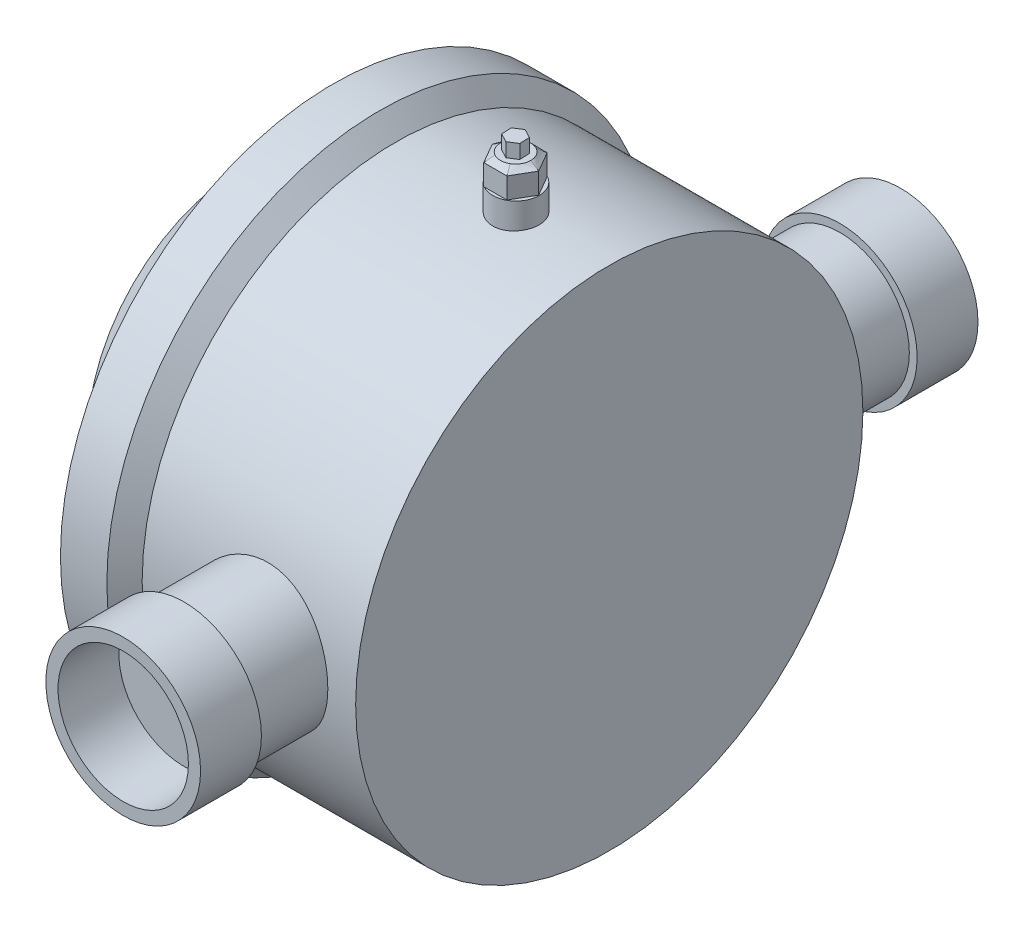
ISO-10303-21;
HEADER;
FILE_DESCRIPTION(('STEP AP214'),'2;1');
FILE_NAME('part.step','',(''),(''),'','','');
FILE_SCHEMA(('AUTOMOTIVE_DESIGN { 1 0 10303 214 1 1 1 1 }'));
ENDSEC;
DATA;
#1=APPLICATION_CONTEXT('core data for automotive mechanical design processes');
#2=APPLICATION_PROTOCOL_DEFINITION('international standard','automotive_design',2000,#1);
#3=PRODUCT_CONTEXT('',#1,'mechanical');
#4=PRODUCT('Part','Part','',(#3));
#5=PRODUCT_RELATED_PRODUCT_CATEGORY('part','',(#4));
#6=PRODUCT_DEFINITION_FORMATION('','',#4);
#7=PRODUCT_DEFINITION_CONTEXT('part definition',#1,'design');
#8=PRODUCT_DEFINITION('design','',#6,#7);
#9=PRODUCT_DEFINITION_SHAPE('','',#8);
#10=(LENGTH_UNIT() NAMED_UNIT(*) SI_UNIT(.MILLI.,.METRE.));
#11=(NAMED_UNIT(*) PLANE_ANGLE_UNIT() SI_UNIT($,.RADIAN.));
#12=(NAMED_UNIT(*) SI_UNIT($,.STERADIAN.) SOLID_ANGLE_UNIT());
#13=UNCERTAINTY_MEASURE_WITH_UNIT(LENGTH_MEASURE(1.E-05),#10,'distance_accuracy_value','');
#14=(GEOMETRIC_REPRESENTATION_CONTEXT(3) GLOBAL_UNCERTAINTY_ASSIGNED_CONTEXT((#13)) GLOBAL_UNIT_ASSIGNED_CONTEXT((#10,
#11,#12)) REPRESENTATION_CONTEXT('',''));
#15=CARTESIAN_POINT('',(0.,0.,0.));
#16=DIRECTION('',(0.,0.,1.));
#17=DIRECTION('',(1.,0.,0.));
#18=AXIS2_PLACEMENT_3D('',#15,#16,#17);
#19=CARTESIAN_POINT('',(-25.,0.,0.));
#20=DIRECTION('',(1.,0.,0.));
#21=DIRECTION('',(0.,0.,-1.));
#22=AXIS2_PLACEMENT_3D('',#19,#20,#21);
#23=PLANE('',#22);
#24=CARTESIAN_POINT('',(-25.,0.,0.));
#25=DIRECTION('',(-1.,0.,0.));
#26=DIRECTION('',(0.,0.,1.));
#27=AXIS2_PLACEMENT_3D('',#24,#25,#26);
#28=CIRCLE('',#27,10.);
#29=CARTESIAN_POINT('',(-25.,0.,10.));
#30=VERTEX_POINT('',#29);
#31=EDGE_CURVE('E96',#30,#30,#28,.T.);
#32=ORIENTED_EDGE('',*,*,#31,.F.);
#33=EDGE_LOOP('',(#32));
#34=FACE_BOUND('',#33,.T.);
#35=CARTESIAN_POINT('',(-25.,0.,0.));
#36=DIRECTION('',(1.,0.,0.));
#37=DIRECTION('',(0.,0.,-1.));
#38=AXIS2_PLACEMENT_3D('',#35,#36,#37);
#39=CIRCLE('',#38,45.);
#40=CARTESIAN_POINT('',(-25.,23.1255284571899,38.603237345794));
#41=VERTEX_POINT('',#40);
#42=EDGE_CURVE('E90',#41,#41,#39,.T.);
#43=ORIENTED_EDGE('',*,*,#42,.F.);
#44=EDGE_LOOP('',(#43));
#45=FACE_BOUND('',#44,.T.);
#46=ADVANCED_FACE('F81',(#34,#45),#23,.F.);
#47=CARTESIAN_POINT('',(0.,0.,0.));
#48=DIRECTION('',(1.,0.,0.));
#49=DIRECTION('',(0.,0.,-1.));
#50=AXIS2_PLACEMENT_3D('',#47,#48,#49);
#51=PLANE('',#50);
#52=CARTESIAN_POINT('',(0.,0.,0.));
#53=DIRECTION('',(1.,0.,0.));
#54=DIRECTION('',(0.,0.,-1.));
#55=AXIS2_PLACEMENT_3D('',#52,#53,#54);
#56=CIRCLE('',#55,10.);
#57=CARTESIAN_POINT('',(0.,0.,10.));
#58=VERTEX_POINT('',#57);
#59=EDGE_CURVE('E151',#58,#58,#56,.F.);
#60=ORIENTED_EDGE('',*,*,#59,.T.);
#61=EDGE_LOOP('',(#60));
#62=FACE_BOUND('',#61,.T.);
#63=CARTESIAN_POINT('',(0.,0.,0.));
#64=DIRECTION('',(1.,0.,0.));
#65=DIRECTION('',(0.,0.,-1.));
#66=AXIS2_PLACEMENT_3D('',#63,#64,#65);
#67=CIRCLE('',#66,73.5);
#68=CARTESIAN_POINT('',(0.,25.331254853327,68.9969385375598));
#69=VERTEX_POINT('',#68);
#70=EDGE_CURVE('E12',#69,#69,#67,.T.);
#71=ORIENTED_EDGE('',*,*,#70,.T.);
#72=EDGE_LOOP('',(#71));
#73=FACE_BOUND('',#72,.T.);
#74=ADVANCED_FACE('F83',(#62,#73),#51,.T.);
#75=CARTESIAN_POINT('',(0.,25.331254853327,68.9969385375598));
#76=CARTESIAN_POINT('',(-25.,23.1255284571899,38.603237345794));
#77=CARTESIAN_POINT('',(0.,163.325131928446,18.3344288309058));
#78=CARTESIAN_POINT('',(-25.,100.332003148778,-7.64781956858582));
#79=CARTESIAN_POINT('',(0.,112.662622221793,-119.659448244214));
#80=CARTESIAN_POINT('',(-25.,54.080946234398,-84.8542942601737));
#81=CARTESIAN_POINT('',(0.,-25.331254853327,-68.9969385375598));
#82=CARTESIAN_POINT('',(-25.,-23.1255284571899,-38.603237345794));
#83=CARTESIAN_POINT('',(0.,-163.325131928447,-18.3344288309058));
#84=CARTESIAN_POINT('',(-25.,-100.332003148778,7.6478195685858));
#85=CARTESIAN_POINT('',(0.,-112.662622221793,119.659448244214));
#86=CARTESIAN_POINT('',(-25.,-54.080946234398,84.8542942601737));
#87=CARTESIAN_POINT('',(0.,25.331254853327,68.9969385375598));
#88=CARTESIAN_POINT('',(-25.,23.1255284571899,38.603237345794));
#89=(BOUNDED_SURFACE() B_SPLINE_SURFACE(3,1,((#75,#76),(#77,#78),(#79,#80),(#81,#82),(#83,#84),
(#85,#86),(#87,#88)),.UNSPECIFIED.,.T.,.F.,.F.) B_SPLINE_SURFACE_WITH_KNOTS((4,3,4),(2,2),(0.,
0.5,1.),(0.,1.),.UNSPECIFIED.) GEOMETRIC_REPRESENTATION_ITEM() RATIONAL_B_SPLINE_SURFACE(((1.,
1.),(0.333333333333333,0.333333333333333),(0.333333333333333,0.333333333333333),(1.,1.),
(0.333333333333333,0.333333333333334),(0.333333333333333,0.333333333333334),(1.,1.))) REPRESENTATION_ITEM('') SURFACE());
#90=CARTESIAN_POINT('',(0.,25.331254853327,68.9969385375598));
#91=CARTESIAN_POINT('',(-0.260416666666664,25.3082785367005,68.6803374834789));
#92=CARTESIAN_POINT('',(-0.520833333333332,25.2853022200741,68.363736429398));
#93=CARTESIAN_POINT('',(-1.04166666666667,25.2393495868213,67.7305343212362));
#94=CARTESIAN_POINT('',(-1.30208333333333,25.2163732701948,67.4139332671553));
#95=CARTESIAN_POINT('',(-1.82291666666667,25.170420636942,66.7807311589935));
#96=CARTESIAN_POINT('',(-2.08333333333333,25.1474443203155,66.4641301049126));
#97=CARTESIAN_POINT('',(-2.60416666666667,25.1014916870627,65.8309279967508));
#98=CARTESIAN_POINT('',(-2.86458333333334,25.0785153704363,65.5143269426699));
#99=CARTESIAN_POINT('',(-3.38541666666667,25.0325627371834,64.8811248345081));
#100=CARTESIAN_POINT('',(-3.64583333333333,25.009586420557,64.5645237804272));
#101=CARTESIAN_POINT('',(-4.16666666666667,24.9636337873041,63.9313216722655));
#102=CARTESIAN_POINT('',(-4.42708333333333,24.9406574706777,63.6147206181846));
#103=CARTESIAN_POINT('',(-4.94791666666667,24.8947048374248,62.9815185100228));
#104=CARTESIAN_POINT('',(-5.20833333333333,24.8717285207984,62.6649174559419));
#105=CARTESIAN_POINT('',(-5.72916666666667,24.8257758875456,62.0317153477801));
#106=CARTESIAN_POINT('',(-5.98958333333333,24.8027995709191,61.7151142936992));
#107=CARTESIAN_POINT('',(-6.51041666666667,24.7568469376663,61.0819121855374));
#108=CARTESIAN_POINT('',(-6.77083333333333,24.7338706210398,60.7653111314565));
#109=CARTESIAN_POINT('',(-7.29166666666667,24.687917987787,60.1321090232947));
#110=CARTESIAN_POINT('',(-7.55208333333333,24.6649416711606,59.8155079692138));
#111=CARTESIAN_POINT('',(-8.07291666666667,24.6189890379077,59.1823058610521));
#112=CARTESIAN_POINT('',(-8.33333333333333,24.5960127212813,58.8657048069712));
#113=CARTESIAN_POINT('',(-8.85416666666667,24.5500600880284,58.2325026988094));
#114=CARTESIAN_POINT('',(-9.11458333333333,24.527083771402,57.9159016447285));
#115=CARTESIAN_POINT('',(-9.63541666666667,24.4811311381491,57.2826995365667));
#116=CARTESIAN_POINT('',(-9.89583333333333,24.4581548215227,56.9660984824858));
#117=CARTESIAN_POINT('',(-10.4166666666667,24.4122021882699,56.332896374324));
#118=CARTESIAN_POINT('',(-10.6770833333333,24.3892258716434,56.0162953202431));
#119=CARTESIAN_POINT('',(-11.1979166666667,24.3432732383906,55.3830932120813));
#120=CARTESIAN_POINT('',(-11.4583333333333,24.3202969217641,55.0664921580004));
#121=CARTESIAN_POINT('',(-11.9791666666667,24.2743442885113,54.4332900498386));
#122=CARTESIAN_POINT('',(-12.2395833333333,24.2513679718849,54.1166889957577));
#123=CARTESIAN_POINT('',(-12.7604166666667,24.205415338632,53.483486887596));
#124=CARTESIAN_POINT('',(-13.0208333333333,24.1824390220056,53.1668858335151));
#125=CARTESIAN_POINT('',(-13.5416666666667,24.1364863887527,52.5336837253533));
#126=CARTESIAN_POINT('',(-13.8020833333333,24.1135100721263,52.2170826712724));
#127=CARTESIAN_POINT('',(-14.3229166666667,24.0675574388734,51.5838805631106));
#128=CARTESIAN_POINT('',(-14.5833333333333,24.044581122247,51.2672795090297));
#129=CARTESIAN_POINT('',(-15.1041666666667,23.9986284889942,50.6340774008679));
#130=CARTESIAN_POINT('',(-15.3645833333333,23.9756521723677,50.317476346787));
#131=CARTESIAN_POINT('',(-15.8854166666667,23.9296995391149,49.6842742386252));
#132=CARTESIAN_POINT('',(-16.1458333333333,23.9067232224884,49.3676731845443));
#133=CARTESIAN_POINT('',(-16.6666666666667,23.8607705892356,48.7344710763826));
#134=CARTESIAN_POINT('',(-16.9270833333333,23.8377942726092,48.4178700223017));
#135=CARTESIAN_POINT('',(-17.4479166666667,23.7918416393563,47.7846679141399));
#136=CARTESIAN_POINT('',(-17.7083333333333,23.7688653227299,47.468066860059));
#137=CARTESIAN_POINT('',(-18.2291666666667,23.722912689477,46.8348647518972));
#138=CARTESIAN_POINT('',(-18.4895833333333,23.6999363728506,46.5182636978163));
#139=CARTESIAN_POINT('',(-19.0104166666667,23.6539837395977,45.8850615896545));
#140=CARTESIAN_POINT('',(-19.2708333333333,23.6310074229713,45.5684605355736));
#141=CARTESIAN_POINT('',(-19.7916666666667,23.5850547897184,44.9352584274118));
#142=CARTESIAN_POINT('',(-20.0520833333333,23.562078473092,44.6186573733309));
#143=CARTESIAN_POINT('',(-20.5729166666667,23.5161258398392,43.9854552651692));
#144=CARTESIAN_POINT('',(-20.8333333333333,23.4931495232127,43.6688542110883));
#145=CARTESIAN_POINT('',(-21.3541666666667,23.4471968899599,43.0356521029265));
#146=CARTESIAN_POINT('',(-21.6145833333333,23.4242205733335,42.7190510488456));
#147=CARTESIAN_POINT('',(-22.1354166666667,23.3782679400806,42.0858489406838));
#148=CARTESIAN_POINT('',(-22.3958333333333,23.3552916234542,41.7692478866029));
#149=CARTESIAN_POINT('',(-22.9166666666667,23.3093389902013,41.1360457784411));
#150=CARTESIAN_POINT('',(-23.1770833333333,23.2863626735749,40.8194447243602));
#151=CARTESIAN_POINT('',(-23.6979166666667,23.240410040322,40.1862426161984));
#152=CARTESIAN_POINT('',(-23.9583333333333,23.2174337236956,39.8696415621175));
#153=CARTESIAN_POINT('',(-24.4791666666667,23.1714810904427,39.2364394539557));
#154=CARTESIAN_POINT('',(-24.7395833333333,23.1485047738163,38.9198383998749));
#155=CARTESIAN_POINT('',(-25.,23.1255284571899,38.603237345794));
#156=B_SPLINE_CURVE_WITH_KNOTS('',3,(#90,#91,#92,#93,#94,#95,#96,#97,#98,#99,#100,#101,#102,
#103,#104,#105,#106,#107,#108,#109,#110,#111,#112,#113,#114,#115,#116,#117,#118,#119,#120,#121,
#122,#123,#124,#125,#126,#127,#128,#129,#130,#131,#132,#133,#134,#135,#136,#137,#138,#139,#140,
#141,#142,#143,#144,#145,#146,#147,#148,#149,#150,#151,#152,#153,#154,#155),.UNSPECIFIED.,.F.,
.F.,(4,2,2,2,2,2,2,2,2,2,2,2,2,2,2,2,2,2,2,2,2,2,2,2,2,2,2,2,2,2,2,2,4),(0.,1.23175842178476,
2.4635168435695,3.69527526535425,4.927033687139,6.15879210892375,7.3905505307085,
8.62230895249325,9.854067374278,11.0858257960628,12.3175842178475,13.5493426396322,
14.781101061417,16.0128594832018,17.2446179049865,18.4763763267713,19.708134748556,
20.9398931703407,22.1716515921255,23.4034100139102,24.635168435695,25.8669268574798,
27.0986852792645,28.3304437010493,29.562202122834,30.7939605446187,32.0257189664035,
33.2574773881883,34.489235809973,35.7209942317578,36.9527526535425,38.1845110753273,
39.416269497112),.UNSPECIFIED.);
#157=EDGE_CURVE('BSEAM119',#69,#41,#156,.T.);
#158=ORIENTED_EDGE('',*,*,#70,.F.);
#159=ORIENTED_EDGE('',*,*,#42,.T.);
#160=ORIENTED_EDGE('',*,*,#157,.T.);
#161=ORIENTED_EDGE('',*,*,#157,.F.);
#162=EDGE_LOOP('',(#158,#160,#159,#161));
#163=FACE_BOUND('',#162,.T.);
#164=ADVANCED_FACE('F119',(#163),#89,.T.);
#165=CARTESIAN_POINT('',(80.0702178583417,0.,0.));
#166=DIRECTION('',(-1.,0.,0.));
#167=DIRECTION('',(0.,0.,1.));
#168=AXIS2_PLACEMENT_3D('',#165,#166,#167);
#169=CYLINDRICAL_SURFACE('',#168,10.);
#170=CARTESIAN_POINT('',(0.,0.,10.));
#171=CARTESIAN_POINT('',(-0.260416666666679,0.,10.));
#172=CARTESIAN_POINT('',(-0.520833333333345,0.,10.));
#173=CARTESIAN_POINT('',(-1.04166666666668,0.,10.));
#174=CARTESIAN_POINT('',(-1.30208333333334,0.,10.));
#175=CARTESIAN_POINT('',(-1.82291666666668,0.,10.));
#176=CARTESIAN_POINT('',(-2.08333333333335,0.,10.));
#177=CARTESIAN_POINT('',(-2.60416666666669,0.,10.));
#178=CARTESIAN_POINT('',(-2.86458333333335,0.,10.));
#179=CARTESIAN_POINT('',(-3.38541666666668,0.,10.));
#180=CARTESIAN_POINT('',(-3.64583333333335,0.,10.));
#181=CARTESIAN_POINT('',(-4.16666666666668,0.,10.));
#182=CARTESIAN_POINT('',(-4.42708333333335,0.,10.));
#183=CARTESIAN_POINT('',(-4.94791666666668,0.,10.));
#184=CARTESIAN_POINT('',(-5.20833333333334,0.,10.));
#185=CARTESIAN_POINT('',(-5.72916666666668,0.,10.));
#186=CARTESIAN_POINT('',(-5.98958333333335,0.,10.));
#187=CARTESIAN_POINT('',(-6.51041666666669,0.,10.));
#188=CARTESIAN_POINT('',(-6.77083333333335,0.,10.));
#189=CARTESIAN_POINT('',(-7.29166666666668,0.,10.));
#190=CARTESIAN_POINT('',(-7.55208333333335,0.,10.));
#191=CARTESIAN_POINT('',(-8.07291666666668,0.,10.));
#192=CARTESIAN_POINT('',(-8.33333333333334,0.,10.));
#193=CARTESIAN_POINT('',(-8.85416666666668,0.,10.));
#194=CARTESIAN_POINT('',(-9.11458333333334,0.,10.));
#195=CARTESIAN_POINT('',(-9.63541666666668,0.,10.));
#196=CARTESIAN_POINT('',(-9.89583333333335,0.,10.));
#197=CARTESIAN_POINT('',(-10.4166666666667,0.,10.));
#198=CARTESIAN_POINT('',(-10.6770833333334,0.,10.));
#199=CARTESIAN_POINT('',(-11.1979166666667,0.,10.));
#200=CARTESIAN_POINT('',(-11.4583333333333,0.,10.));
#201=CARTESIAN_POINT('',(-11.9791666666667,0.,10.));
#202=CARTESIAN_POINT('',(-12.2395833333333,0.,10.));
#203=CARTESIAN_POINT('',(-12.7604166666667,0.,10.));
#204=CARTESIAN_POINT('',(-13.0208333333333,0.,10.));
#205=CARTESIAN_POINT('',(-13.5416666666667,0.,10.));
#206=CARTESIAN_POINT('',(-13.8020833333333,0.,10.));
#207=CARTESIAN_POINT('',(-14.3229166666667,0.,10.));
#208=CARTESIAN_POINT('',(-14.5833333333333,0.,10.));
#209=CARTESIAN_POINT('',(-15.1041666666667,0.,10.));
#210=CARTESIAN_POINT('',(-15.3645833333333,0.,10.));
#211=CARTESIAN_POINT('',(-15.8854166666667,0.,10.));
#212=CARTESIAN_POINT('',(-16.1458333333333,0.,10.));
#213=CARTESIAN_POINT('',(-16.6666666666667,0.,10.));
#214=CARTESIAN_POINT('',(-16.9270833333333,0.,10.));
#215=CARTESIAN_POINT('',(-17.4479166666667,0.,10.));
#216=CARTESIAN_POINT('',(-17.7083333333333,0.,10.));
#217=CARTESIAN_POINT('',(-18.2291666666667,0.,10.));
#218=CARTESIAN_POINT('',(-18.4895833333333,0.,10.));
#219=CARTESIAN_POINT('',(-19.0104166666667,0.,10.));
#220=CARTESIAN_POINT('',(-19.2708333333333,0.,10.));
#221=CARTESIAN_POINT('',(-19.7916666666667,0.,10.));
#222=CARTESIAN_POINT('',(-20.0520833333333,0.,10.));
#223=CARTESIAN_POINT('',(-20.5729166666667,0.,10.));
#224=CARTESIAN_POINT('',(-20.8333333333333,0.,10.));
#225=CARTESIAN_POINT('',(-21.3541666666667,0.,10.));
#226=CARTESIAN_POINT('',(-21.6145833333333,0.,10.));
#227=CARTESIAN_POINT('',(-22.1354166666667,0.,10.));
#228=CARTESIAN_POINT('',(-22.3958333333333,0.,10.));
#229=CARTESIAN_POINT('',(-22.9166666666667,0.,10.));
#230=CARTESIAN_POINT('',(-23.1770833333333,0.,10.));
#231=CARTESIAN_POINT('',(-23.6979166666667,0.,10.));
#232=CARTESIAN_POINT('',(-23.9583333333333,0.,10.));
#233=CARTESIAN_POINT('',(-24.4791666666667,0.,10.));
#234=CARTESIAN_POINT('',(-24.7395833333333,0.,10.));
#235=CARTESIAN_POINT('',(-25.,0.,10.));
#236=B_SPLINE_CURVE_WITH_KNOTS('',3,(#170,#171,#172,#173,#174,#175,#176,#177,#178,#179,#180,
#181,#182,#183,#184,#185,#186,#187,#188,#189,#190,#191,#192,#193,#194,#195,#196,#197,#198,#199,
#200,#201,#202,#203,#204,#205,#206,#207,#208,#209,#210,#211,#212,#213,#214,#215,#216,#217,#218,
#219,#220,#221,#222,#223,#224,#225,#226,#227,#228,#229,#230,#231,#232,#233,#234,#235),
.UNSPECIFIED.,.F.,.F.,(4,2,2,2,2,2,2,2,2,2,2,2,2,2,2,2,2,2,2,2,2,2,2,2,2,2,2,2,2,2,2,2,4),(0.,
0.781249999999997,1.56249999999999,2.34375000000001,3.125,3.90625,4.6875,5.46874999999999,
6.25000000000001,7.03125,7.8125,8.59375,9.37499999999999,10.15625,10.9375,11.71875,12.5,
13.28125,14.0625,14.84375,15.625,16.40625,17.1875,17.96875,18.75,19.53125,20.3125,21.09375,
21.875,22.65625,23.4375,24.21875,25.),.UNSPECIFIED.);
#237=EDGE_CURVE('BSEAM118',#58,#30,#236,.T.);
#238=ORIENTED_EDGE('',*,*,#59,.F.);
#239=ORIENTED_EDGE('',*,*,#31,.T.);
#240=ORIENTED_EDGE('',*,*,#237,.T.);
#241=ORIENTED_EDGE('',*,*,#237,.F.);
#242=EDGE_LOOP('',(#238,#240,#239,#241));
#243=FACE_BOUND('',#242,.T.);
#244=ADVANCED_FACE('F118',(#243),#169,.F.);
#245=CLOSED_SHELL('',(#46,#74,#164,#244));
#246=MANIFOLD_SOLID_BREP('B2',#245);
#247=CARTESIAN_POINT('',(53.1272575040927,87.75,0.));
#248=DIRECTION('',(0.,1.,0.));
#249=DIRECTION('',(0.,0.,1.));
#250=AXIS2_PLACEMENT_3D('',#247,#248,#249);
#251=PLANE('',#250);
#252=CARTESIAN_POINT('',(53.1272575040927,87.75,0.));
#253=DIRECTION('',(0.,1.,0.));
#254=DIRECTION('',(0.,0.,1.));
#255=AXIS2_PLACEMENT_3D('',#252,#253,#254);
#256=CIRCLE('',#255,4.35);
#257=CARTESIAN_POINT('',(55.3022575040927,87.75,-3.76721050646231));
#258=VERTEX_POINT('',#257);
#259=CARTESIAN_POINT('',(50.9522575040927,87.75,-3.76721050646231));
#260=VERTEX_POINT('',#259);
#261=EDGE_CURVE('E466',#258,#260,#256,.T.);
#262=ORIENTED_EDGE('',*,*,#261,.T.);
#263=CARTESIAN_POINT('',(48.7772575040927,87.75,0.));
#264=VERTEX_POINT('',#263);
#265=EDGE_CURVE('E471',#260,#264,#256,.T.);
#266=ORIENTED_EDGE('',*,*,#265,.T.);
#267=CARTESIAN_POINT('',(50.9522575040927,87.75,3.76721050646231));
#268=VERTEX_POINT('',#267);
#269=EDGE_CURVE('E448',#264,#268,#256,.T.);
#270=ORIENTED_EDGE('',*,*,#269,.T.);
#271=CARTESIAN_POINT('',(55.3022575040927,87.75,3.76721050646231));
#272=VERTEX_POINT('',#271);
#273=EDGE_CURVE('E378',#268,#272,#256,.T.);
#274=ORIENTED_EDGE('',*,*,#273,.T.);
#275=CARTESIAN_POINT('',(57.4772575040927,87.75,0.));
#276=VERTEX_POINT('',#275);
#277=EDGE_CURVE('E368',#272,#276,#256,.T.);
#278=ORIENTED_EDGE('',*,*,#277,.T.);
#279=EDGE_CURVE('E364',#276,#258,#256,.T.);
#280=ORIENTED_EDGE('',*,*,#279,.T.);
#281=EDGE_LOOP('',(#262,#266,#270,#274,#278,#280));
#282=FACE_BOUND('',#281,.T.);
#283=DIRECTION('',(0.887009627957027,0.,0.461750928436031));
#284=VECTOR('',#283,1.);
#285=CARTESIAN_POINT('',(50.6717686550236,87.75,1.5510440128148));
#286=LINE('',#285,#284);
#287=CARTESIAN_POINT('',(50.6717686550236,87.75,1.5510440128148));
#288=VERTEX_POINT('',#287);
#289=CARTESIAN_POINT('',(53.2323448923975,87.75,2.88400412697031));
#290=VERTEX_POINT('',#289);
#291=EDGE_CURVE('E980',#288,#290,#286,.T.);
#292=ORIENTED_EDGE('',*,*,#291,.F.);
#293=DIRECTION('',(0.0436167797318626,0.,0.999048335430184));
#294=VECTOR('',#293,1.);
#295=CARTESIAN_POINT('',(50.5458578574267,87.75,-1.33296011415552));
#296=LINE('',#295,#294);
#297=CARTESIAN_POINT('',(50.5458578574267,87.75,-1.33296011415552));
#298=VERTEX_POINT('',#297);
#299=EDGE_CURVE('E982',#298,#288,#296,.T.);
#300=ORIENTED_EDGE('',*,*,#299,.F.);
#301=DIRECTION('',(-0.843392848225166,0.,0.537297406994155));
#302=VECTOR('',#301,1.);
#303=CARTESIAN_POINT('',(52.9805232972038,87.75,-2.88400412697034));
#304=LINE('',#303,#302);
#305=CARTESIAN_POINT('',(52.9805232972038,87.75,-2.88400412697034));
#306=VERTEX_POINT('',#305);
#307=EDGE_CURVE('E970',#306,#298,#304,.T.);
#308=ORIENTED_EDGE('',*,*,#307,.F.);
#309=DIRECTION('',(-0.887009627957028,0.,-0.461750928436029));
#310=VECTOR('',#309,1.);
#311=CARTESIAN_POINT('',(55.5410995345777,87.75,-1.55104401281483));
#312=LINE('',#311,#310);
#313=CARTESIAN_POINT('',(55.5410995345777,87.75,-1.55104401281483));
#314=VERTEX_POINT('',#313);
#315=EDGE_CURVE('E972',#314,#306,#312,.T.);
#316=ORIENTED_EDGE('',*,*,#315,.F.);
#317=DIRECTION('',(-0.0436167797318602,0.,-0.999048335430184));
#318=VECTOR('',#317,1.);
#319=CARTESIAN_POINT('',(55.6670103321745,87.75,1.33296011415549));
#320=LINE('',#319,#318);
#321=CARTESIAN_POINT('',(55.6670103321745,87.75,1.33296011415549));
#322=VERTEX_POINT('',#321);
#323=EDGE_CURVE('E974',#322,#314,#320,.T.);
#324=ORIENTED_EDGE('',*,*,#323,.F.);
#325=DIRECTION('',(0.843392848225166,0.,-0.537297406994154));
#326=VECTOR('',#325,1.);
#327=CARTESIAN_POINT('',(53.2323448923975,87.75,2.88400412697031));
#328=LINE('',#327,#326);
#329=EDGE_CURVE('E977',#290,#322,#328,.T.);
#330=ORIENTED_EDGE('',*,*,#329,.F.);
#331=EDGE_LOOP('',(#292,#300,#308,#316,#324,#330));
#332=FACE_BOUND('',#331,.T.);
#333=ADVANCED_FACE('F186',(#282,#332),#251,.T.);
#334=CARTESIAN_POINT('',(53.2452162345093,80.25,0.));
#335=DIRECTION('',(0.,1.,0.));
#336=DIRECTION('',(0.,0.,1.));
#337=AXIS2_PLACEMENT_3D('',#334,#335,#336);
#338=PLANE('',#337);
#339=DIRECTION('',(-0.499999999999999,0.,0.866025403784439));
#340=VECTOR('',#339,1.);
#341=CARTESIAN_POINT('',(49.7378529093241,80.25,-5.78071957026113));
#342=LINE('',#341,#340);
#343=CARTESIAN_POINT('',(49.6458853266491,80.25,-5.62142704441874));
#344=VERTEX_POINT('',#343);
#345=CARTESIAN_POINT('',(46.5772521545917,80.25,-0.306398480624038));
#346=VERTEX_POINT('',#345);
#347=EDGE_CURVE('E79',#344,#346,#342,.T.);
#348=ORIENTED_EDGE('',*,*,#347,.F.);
#349=CARTESIAN_POINT('',(53.2452162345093,80.25,0.));
#350=DIRECTION('',(0.,1.,0.));
#351=DIRECTION('',(0.,0.,1.));
#352=AXIS2_PLACEMENT_3D('',#349,#350,#351);
#353=CIRCLE('',#352,6.675);
#354=EDGE_CURVE('E540',#344,#346,#353,.T.);
#355=ORIENTED_EDGE('',*,*,#354,.T.);
#356=EDGE_LOOP('',(#348,#355));
#357=FACE_BOUND('',#356,.T.);
#358=ADVANCED_FACE('F496',(#357),#338,.T.);
#359=DIRECTION('',(-1.,0.,0.));
#360=VECTOR('',#359,1.);
#361=CARTESIAN_POINT('',(56.4128529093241,80.25,-5.78071957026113));
#362=LINE('',#361,#360);
#363=CARTESIAN_POINT('',(56.4128529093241,80.25,-5.78071957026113));
#364=VERTEX_POINT('',#363);
#365=CARTESIAN_POINT('',(49.9077162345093,80.25,-5.78071957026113));
#366=VERTEX_POINT('',#365);
#367=EDGE_CURVE('E214',#364,#366,#362,.T.);
#368=ORIENTED_EDGE('',*,*,#367,.F.);
#369=DIRECTION('',(-0.5,0.,-0.866025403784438));
#370=VECTOR('',#369,1.);
#371=CARTESIAN_POINT('',(59.7503529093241,80.25,0.));
#372=LINE('',#371,#370);
#373=CARTESIAN_POINT('',(59.7503529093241,80.25,0.));
#374=VERTEX_POINT('',#373);
#375=EDGE_CURVE('E303',#374,#364,#372,.T.);
#376=ORIENTED_EDGE('',*,*,#375,.F.);
#377=DIRECTION('',(0.500000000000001,0.,-0.866025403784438));
#378=VECTOR('',#377,1.);
#379=CARTESIAN_POINT('',(56.4128529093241,80.25,5.78071957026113));
#380=LINE('',#379,#378);
#381=CARTESIAN_POINT('',(56.4128529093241,80.25,5.78071957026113));
#382=VERTEX_POINT('',#381);
#383=EDGE_CURVE('E299',#382,#374,#380,.T.);
#384=ORIENTED_EDGE('',*,*,#383,.F.);
#385=DIRECTION('',(1.,0.,0.));
#386=VECTOR('',#385,1.);
#387=CARTESIAN_POINT('',(49.7378529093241,80.25,5.78071957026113));
#388=LINE('',#387,#386);
#389=CARTESIAN_POINT('',(49.9077162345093,80.25,5.78071957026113));
#390=VERTEX_POINT('',#389);
#391=EDGE_CURVE('E195',#390,#382,#388,.T.);
#392=ORIENTED_EDGE('',*,*,#391,.F.);
#393=EDGE_CURVE('E332',#390,#366,#353,.T.);
#394=ORIENTED_EDGE('',*,*,#393,.T.);
#395=EDGE_LOOP('',(#368,#376,#384,#392,#394));
#396=FACE_BOUND('',#395,.T.);
#397=ADVANCED_FACE('F301',(#396),#338,.T.);
#398=CARTESIAN_POINT('',(80.0692178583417,-67.95,0.));
#399=DIRECTION('',(1.,0.,0.));
#400=DIRECTION('',(0.,0.,-1.));
#401=AXIS2_PLACEMENT_3D('',#398,#399,#400);
#402=PLANE('',#401);
#403=CARTESIAN_POINT('',(80.0692178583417,0.,0.));
#404=DIRECTION('',(-1.,0.,0.));
#405=DIRECTION('',(0.,0.,1.));
#406=AXIS2_PLACEMENT_3D('',#403,#404,#405);
#407=CIRCLE('',#406,72.95);
#408=CARTESIAN_POINT('',(80.0692178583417,0.,72.95));
#409=VERTEX_POINT('',#408);
#410=EDGE_CURVE('E585',#409,#409,#407,.T.);
#411=ORIENTED_EDGE('',*,*,#410,.F.);
#412=EDGE_LOOP('',(#411));
#413=FACE_BOUND('',#412,.T.);
#414=ADVANCED_FACE('F188',(#413),#402,.T.);
#415=CARTESIAN_POINT('',(-34.6008005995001,0.,0.));
#416=DIRECTION('',(-1.,0.,0.));
#417=DIRECTION('',(0.,0.,1.));
#418=AXIS2_PLACEMENT_3D('',#415,#416,#417);
#419=CYLINDRICAL_SURFACE('',#418,72.95);
#420=CARTESIAN_POINT('',(53.2452162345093,72.643973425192,6.675));
#421=CARTESIAN_POINT('',(53.4323299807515,72.6439729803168,6.67500175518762));
#422=CARTESIAN_POINT('',(53.6194166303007,72.6446978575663,6.667129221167));
#423=CARTESIAN_POINT('',(53.9923166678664,72.647575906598,6.63569696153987));
#424=CARTESIAN_POINT('',(54.1781297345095,72.6497294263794,6.61213341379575));
#425=CARTESIAN_POINT('',(54.5472454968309,72.6554063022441,6.54945960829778));
#426=CARTESIAN_POINT('',(54.7305460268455,72.6589307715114,6.51033671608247));
#427=CARTESIAN_POINT('',(55.0932499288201,72.6672499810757,6.41681253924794));
#428=CARTESIAN_POINT('',(55.2726518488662,72.6720451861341,6.36240566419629));
#429=CARTESIAN_POINT('',(55.6260461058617,72.6827631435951,6.23877267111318));
#430=CARTESIAN_POINT('',(55.8000434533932,72.6886848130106,6.169560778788));
#431=CARTESIAN_POINT('',(56.1416444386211,72.7014925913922,6.01675590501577));
#432=CARTESIAN_POINT('',(56.3092456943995,72.7083790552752,5.93315762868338));
#433=CARTESIAN_POINT('',(56.636713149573,72.7229151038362,5.75224691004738));
#434=CARTESIAN_POINT('',(56.7965837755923,72.7305642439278,5.65494244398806));
#435=CARTESIAN_POINT('',(57.1076321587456,72.7464156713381,5.44723368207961));
#436=CARTESIAN_POINT('',(57.2588066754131,72.754618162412,5.33682454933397));
#437=CARTESIAN_POINT('',(57.5516863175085,72.771362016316,5.10343852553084));
#438=CARTESIAN_POINT('',(57.6933682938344,72.7799041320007,4.98043263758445));
#439=CARTESIAN_POINT('',(57.9659265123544,72.7970704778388,4.72288965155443));
#440=CARTESIAN_POINT('',(58.0967987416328,72.8056947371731,4.58834830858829));
#441=CARTESIAN_POINT('',(58.3467170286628,72.8227755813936,4.30876542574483));
#442=CARTESIAN_POINT('',(58.4657669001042,72.8312322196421,4.16372729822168));
#443=CARTESIAN_POINT('',(58.6912895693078,72.847744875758,3.86407641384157));
#444=CARTESIAN_POINT('',(58.7977577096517,72.8558007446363,3.7094601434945));
#445=CARTESIAN_POINT('',(58.9974482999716,72.8712914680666,3.39156761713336));
#446=CARTESIAN_POINT('',(59.0906521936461,72.878725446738,3.22827965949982));
#447=CARTESIAN_POINT('',(59.2630028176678,72.8927516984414,2.89433831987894));
#448=CARTESIAN_POINT('',(59.3421443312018,72.8993436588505,2.72368223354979));
#449=CARTESIAN_POINT('',(59.4857293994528,72.9114925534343,2.3763219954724));
#450=CARTESIAN_POINT('',(59.55017861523,72.9170498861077,2.19962020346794));
#451=CARTESIAN_POINT('',(59.6639692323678,72.9269778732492,1.84136569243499));
#452=CARTESIAN_POINT('',(59.7133050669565,72.9313480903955,1.6598112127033));
#453=CARTESIAN_POINT('',(59.8377482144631,72.9424508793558,1.11096785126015));
#454=CARTESIAN_POINT('',(59.8898563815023,72.9472250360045,0.738127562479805));
#455=CARTESIAN_POINT('',(59.9307501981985,72.9509622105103,-0.0108324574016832));
#456=CARTESIAN_POINT('',(59.9195372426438,72.9499253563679,-0.386952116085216));
#457=CARTESIAN_POINT('',(59.8343322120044,72.942179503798,-1.13085587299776));
#458=CARTESIAN_POINT('',(59.7605281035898,72.935487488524,-1.49866154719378));
#459=CARTESIAN_POINT('',(59.5525062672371,72.9172005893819,-2.21662854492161));
#460=CARTESIAN_POINT('',(59.4182878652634,72.9056056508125,-2.56678967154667));
#461=CARTESIAN_POINT('',(59.0930453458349,72.8787884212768,-3.24014115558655));
#462=CARTESIAN_POINT('',(58.9019374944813,72.8635607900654,-3.5632908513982));
#463=CARTESIAN_POINT('',(58.4684001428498,72.8311880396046,-4.17299789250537));
#464=CARTESIAN_POINT('',(58.2259693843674,72.8140428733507,-4.45955434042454));
#465=CARTESIAN_POINT('',(57.6956097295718,72.7796864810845,-4.98904210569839));
#466=CARTESIAN_POINT('',(57.4075173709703,72.7624752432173,-5.23180972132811));
#467=CARTESIAN_POINT('',(56.7945805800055,72.7299894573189,-5.66556223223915));
#468=CARTESIAN_POINT('',(56.4697361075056,72.7147149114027,-5.85654707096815));
#469=CARTESIAN_POINT('',(55.7923962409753,72.6878298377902,-6.18130907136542));
#470=CARTESIAN_POINT('',(55.4398963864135,72.6762199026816,-6.31507698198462));
#471=CARTESIAN_POINT('',(54.717310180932,72.6579905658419,-6.52148282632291));
#472=CARTESIAN_POINT('',(54.3472242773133,72.6513710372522,-6.5941223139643));
#473=CARTESIAN_POINT('',(53.6014060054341,72.6438932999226,-6.67600055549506));
#474=CARTESIAN_POINT('',(53.2256989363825,72.6430143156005,-6.68546793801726));
#475=CARTESIAN_POINT('',(52.4780433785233,72.647062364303,-6.64133282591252));
#476=CARTESIAN_POINT('',(52.1060948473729,72.6519893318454,-6.58773104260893));
#477=CARTESIAN_POINT('',(51.3771756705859,72.6670752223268,-6.41917010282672));
#478=CARTESIAN_POINT('',(51.0201799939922,72.6772249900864,-6.30431830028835));
#479=CARTESIAN_POINT('',(50.3305236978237,72.701605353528,-6.01662679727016));
#480=CARTESIAN_POINT('',(49.9978635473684,72.7158360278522,-5.8437859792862));
#481=CARTESIAN_POINT('',(49.3652769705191,72.7468251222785,-5.4444473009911));
#482=CARTESIAN_POINT('',(49.0654468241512,72.7635906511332,-5.21779748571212));
#483=CARTESIAN_POINT('',(48.5080060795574,72.7977367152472,-4.71749191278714));
#484=CARTESIAN_POINT('',(48.2503963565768,72.8151172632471,-4.44383518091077));
#485=CARTESIAN_POINT('',(47.7839243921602,72.8485974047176,-3.85629909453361));
#486=CARTESIAN_POINT('',(47.5752109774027,72.8646929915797,-3.54230133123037));
#487=CARTESIAN_POINT('',(47.2134807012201,72.8937312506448,-2.88356533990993));
#488=CARTESIAN_POINT('',(47.0604631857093,72.9066739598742,-2.53882747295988));
#489=CARTESIAN_POINT('',(46.8147151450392,72.9279314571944,-1.8289938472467));
#490=CARTESIAN_POINT('',(46.7218935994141,72.9362532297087,-1.46392973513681));
#491=CARTESIAN_POINT('',(46.5989017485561,72.9473539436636,-0.723113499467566));
#492=CARTESIAN_POINT('',(46.5687299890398,72.9501330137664,-0.347361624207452));
#493=CARTESIAN_POINT('',(46.5710446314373,72.9499256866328,0.214999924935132));
#494=CARTESIAN_POINT('',(46.5797030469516,72.9491311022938,0.402001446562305));
#495=CARTESIAN_POINT('',(46.6126793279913,72.9461245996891,0.774588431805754));
#496=CARTESIAN_POINT('',(46.6369913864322,72.9439132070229,0.960174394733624));
#497=CARTESIAN_POINT('',(46.701116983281,72.9381320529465,1.32868357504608));
#498=CARTESIAN_POINT('',(46.7409362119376,72.9345617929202,1.51160578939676));
#499=CARTESIAN_POINT('',(46.8357659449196,72.9261660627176,1.873371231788));
#500=CARTESIAN_POINT('',(46.8907708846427,72.9213410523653,2.05221592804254));
#501=CARTESIAN_POINT('',(47.0155993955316,72.9105694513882,2.40467523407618));
#502=CARTESIAN_POINT('',(47.0854269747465,72.904622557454,2.57828841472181));
#503=CARTESIAN_POINT('',(47.2393626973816,72.8917778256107,2.9189504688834));
#504=CARTESIAN_POINT('',(47.3234656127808,72.8848803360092,3.0860017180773));
#505=CARTESIAN_POINT('',(47.505403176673,72.8703239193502,3.4124929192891));
#506=CARTESIAN_POINT('',(47.6032426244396,72.8626647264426,3.57193018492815));
#507=CARTESIAN_POINT('',(47.8119004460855,72.8468048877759,3.8819590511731));
#508=CARTESIAN_POINT('',(47.9227140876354,72.8386044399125,4.03255384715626));
#509=CARTESIAN_POINT('',(48.1570233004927,72.8218571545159,4.32447483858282));
#510=CARTESIAN_POINT('',(48.2805663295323,72.8133090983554,4.46576287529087));
#511=CARTESIAN_POINT('',(48.5390568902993,72.7961413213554,4.73738595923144));
#512=CARTESIAN_POINT('',(48.6740002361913,72.787521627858,4.86772499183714));
#513=CARTESIAN_POINT('',(48.9544675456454,72.7704459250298,5.11666692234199));
#514=CARTESIAN_POINT('',(49.0999979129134,72.7619900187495,5.23526261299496));
#515=CARTESIAN_POINT('',(49.4004871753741,72.7454900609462,5.4597474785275));
#516=CARTESIAN_POINT('',(49.5554425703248,72.7374458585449,5.56564132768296));
#517=CARTESIAN_POINT('',(49.8741487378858,72.7219745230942,5.76427580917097));
#518=CARTESIAN_POINT('',(50.0379209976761,72.7145490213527,5.85698209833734));
#519=CARTESIAN_POINT('',(50.3726730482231,72.7005531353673,6.02822150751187));
#520=CARTESIAN_POINT('',(50.5436501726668,72.6939824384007,6.10675981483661));
#521=CARTESIAN_POINT('',(50.8915132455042,72.6818864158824,6.24907908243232));
#522=CARTESIAN_POINT('',(51.0683941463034,72.6763602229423,6.31287229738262));
#523=CARTESIAN_POINT('',(51.4268777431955,72.6665061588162,6.42530622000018));
#524=CARTESIAN_POINT('',(51.6084792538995,72.662177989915,6.47395069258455));
#525=CARTESIAN_POINT('',(52.0301151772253,72.6537451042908,6.56800735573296));
#526=CARTESIAN_POINT('',(52.2713663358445,72.6500952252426,6.60809178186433));
#527=CARTESIAN_POINT('',(52.7568324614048,72.6452096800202,6.66158691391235));
#528=CARTESIAN_POINT('',(53.0010474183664,72.6439740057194,6.67499770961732));
#529=CARTESIAN_POINT('',(53.2452162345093,72.643973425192,6.675));
#530=B_SPLINE_CURVE_WITH_KNOTS('',3,(#420,#421,#422,#423,#424,#425,#426,#427,#428,#429,#430,
#431,#432,#433,#434,#435,#436,#437,#438,#439,#440,#441,#442,#443,#444,#445,#446,#447,#448,#449,
#450,#451,#452,#453,#454,#455,#456,#457,#458,#459,#460,#461,#462,#463,#464,#465,#466,#467,#468,
#469,#470,#471,#472,#473,#474,#475,#476,#477,#478,#479,#480,#481,#482,#483,#484,#485,#486,#487,
#488,#489,#490,#491,#492,#493,#494,#495,#496,#497,#498,#499,#500,#501,#502,#503,#504,#505,#506,
#507,#508,#509,#510,#511,#512,#513,#514,#515,#516,#517,#518,#519,#520,#521,#522,#523,#524,#525,
#526,#527,#528,#529),.UNSPECIFIED.,.T.,.F.,(4,2,2,2,2,2,2,2,2,2,2,2,2,2,2,2,2,2,2,2,2,2,2,2,2,2,
2,2,2,2,2,2,2,2,2,2,2,2,2,2,2,2,2,2,2,2,2,2,2,2,2,2,2,2,4),(0.,0.561127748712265,
1.12239223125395,1.68411340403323,2.24604030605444,2.8074296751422,3.36902610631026,
3.93029705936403,4.4917758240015,5.05457743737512,5.61758704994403,6.18041445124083,
6.74344954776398,7.30726473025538,7.87128864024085,8.43509485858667,8.99910849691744,
10.1227396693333,11.2463460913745,12.3665901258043,13.4868466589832,14.6087602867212,
15.7307014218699,16.8567536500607,17.9828071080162,19.1090425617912,20.2352493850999,
21.3573780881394,22.4794941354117,23.5996498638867,24.719827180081,25.8432062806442,
26.9666086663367,28.0933871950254,29.22015249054,30.3452100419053,31.4702414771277,
32.0313063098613,32.5921631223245,33.1532259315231,33.7140834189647,34.2750927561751,
34.8358970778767,35.3968978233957,35.9576945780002,36.5206634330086,37.0834264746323,
37.6465327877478,38.2094312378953,38.7737697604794,39.3379012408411,39.9015621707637,
40.4650829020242,41.1973132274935,41.9295410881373),.UNSPECIFIED.);
#531=CARTESIAN_POINT('',(53.2452162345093,72.643973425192,6.675));
#532=VERTEX_POINT('',#531);
#533=EDGE_CURVE('E654',#532,#532,#530,.T.);
#534=ORIENTED_EDGE('',*,*,#533,.F.);
#535=EDGE_LOOP('',(#534));
#536=FACE_BOUND('',#535,.T.);
#537=CARTESIAN_POINT('',(52.0692178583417,20.0000000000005,-70.1548465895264));
#538=CARTESIAN_POINT('',(52.6195084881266,19.9999981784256,-70.1548478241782));
#539=CARTESIAN_POINT('',(53.1698332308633,19.9772692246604,-70.1613389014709));
#540=CARTESIAN_POINT('',(54.2664615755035,19.8865505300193,-70.1871056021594));
#541=CARTESIAN_POINT('',(54.8127648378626,19.8185570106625,-70.2063822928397));
#542=CARTESIAN_POINT('',(55.8975820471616,19.6378744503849,-70.2571361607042));
#543=CARTESIAN_POINT('',(56.4360927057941,19.5251670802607,-70.2886183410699));
#544=CARTESIAN_POINT('',(57.501261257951,19.256029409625,-70.3628260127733));
#545=CARTESIAN_POINT('',(58.0279193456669,19.0995998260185,-70.4055513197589));
#546=CARTESIAN_POINT('',(59.0650070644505,18.7445697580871,-70.5009028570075));
#547=CARTESIAN_POINT('',(59.5754596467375,18.5460322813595,-70.5535142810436));
#548=CARTESIAN_POINT('',(60.5775878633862,18.1081927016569,-70.6671562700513));
#549=CARTESIAN_POINT('',(61.0692634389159,17.868890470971,-70.7281868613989));
#550=CARTESIAN_POINT('',(62.03073143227,17.3512639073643,-70.8569491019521));
#551=CARTESIAN_POINT('',(62.5005226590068,17.0729374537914,-70.9246811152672));
#552=CARTESIAN_POINT('',(63.4152902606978,16.4791987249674,-71.0649810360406));
#553=CARTESIAN_POINT('',(63.8602661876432,16.163785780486,-71.1375490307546));
#554=CARTESIAN_POINT('',(64.7330058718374,15.489984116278,-71.2873396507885));
#555=CARTESIAN_POINT('',(65.1601038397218,15.1307482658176,-71.3646320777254));
#556=CARTESIAN_POINT('',(65.9827196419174,14.3779460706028,-71.5201010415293));
#557=CARTESIAN_POINT('',(66.3782370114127,13.9843792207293,-71.5982775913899));
#558=CARTESIAN_POINT('',(67.1351729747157,13.1654069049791,-71.753384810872));
#559=CARTESIAN_POINT('',(67.4965879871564,12.7399981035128,-71.8303153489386));
#560=CARTESIAN_POINT('',(68.1828636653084,11.8600895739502,-71.9808305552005));
#561=CARTESIAN_POINT('',(68.5077241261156,11.4055896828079,-72.0544152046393));
#562=CARTESIAN_POINT('',(69.1238427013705,10.4624293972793,-72.197447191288));
#563=CARTESIAN_POINT('',(69.414433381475,9.97331865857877,-72.2668025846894));
#564=CARTESIAN_POINT('',(69.9532615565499,8.97131896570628,-72.3980193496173));
#565=CARTESIAN_POINT('',(70.2014984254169,8.45842966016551,-72.4598806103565));
#566=CARTESIAN_POINT('',(70.6535926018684,7.41252566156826,-72.5743318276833));
#567=CARTESIAN_POINT('',(70.857456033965,6.8795137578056,-72.6269230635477));
#568=CARTESIAN_POINT('',(71.2191144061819,5.79715511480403,-72.7213210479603));
#569=CARTESIAN_POINT('',(71.3769106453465,5.24780883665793,-72.7631281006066));
#570=CARTESIAN_POINT('',(71.6417994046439,4.15030042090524,-72.8338695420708));
#571=CARTESIAN_POINT('',(71.7500240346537,3.60242986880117,-72.8630903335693));
#572=CARTESIAN_POINT('',(71.9203222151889,2.49904942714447,-72.9092731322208));
#573=CARTESIAN_POINT('',(71.9823964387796,1.94353964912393,-72.9262353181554));
#574=CARTESIAN_POINT('',(72.0598282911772,0.829116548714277,-72.9474167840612));
#575=CARTESIAN_POINT('',(72.0751930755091,0.270203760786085,-72.9516380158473));
#576=CARTESIAN_POINT('',(72.0590853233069,-0.846890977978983,-72.9472222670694));
#577=CARTESIAN_POINT('',(72.0276134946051,-1.40507293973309,-72.9385854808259));
#578=CARTESIAN_POINT('',(71.9195856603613,-2.50166154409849,-72.9091009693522));
#579=CARTESIAN_POINT('',(71.8442552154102,-3.04019839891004,-72.888585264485));
#580=CARTESIAN_POINT('',(71.6501425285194,-4.10880523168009,-72.8361612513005));
#581=CARTESIAN_POINT('',(71.5313611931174,-4.63887538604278,-72.804253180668));
#582=CARTESIAN_POINT('',(71.2513212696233,-5.68692692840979,-72.7298933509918));
#583=CARTESIAN_POINT('',(71.0900611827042,-6.20490788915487,-72.6874412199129));
#584=CARTESIAN_POINT('',(70.7263421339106,-7.22531018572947,-72.5931123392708));
#585=CARTESIAN_POINT('',(70.5238824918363,-7.72773126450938,-72.5412354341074));
#586=CARTESIAN_POINT('',(70.0770002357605,-8.71884859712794,-72.4288305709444));
#587=CARTESIAN_POINT('',(69.8321664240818,-9.20734989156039,-72.3682189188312));
#588=CARTESIAN_POINT('',(69.303798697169,-10.1620315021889,-72.2403460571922));
#589=CARTESIAN_POINT('',(69.0202646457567,-10.628211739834,-72.1730848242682));
#590=CARTESIAN_POINT('',(68.416409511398,-11.5354368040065,-72.0336510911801));
#591=CARTESIAN_POINT('',(68.0960821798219,-11.9764773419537,-71.9614777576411));
#592=CARTESIAN_POINT('',(67.4207894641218,-12.8306538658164,-71.814098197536));
#593=CARTESIAN_POINT('',(67.065823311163,-13.2437892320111,-71.738891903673));
#594=CARTESIAN_POINT('',(66.3114543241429,-14.0525554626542,-71.5849363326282));
#595=CARTESIAN_POINT('',(65.9109838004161,-14.4471843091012,-71.5061512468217));
#596=CARTESIAN_POINT('',(65.078135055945,-15.2014381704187,-71.3496123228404));
#597=CARTESIAN_POINT('',(64.6457561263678,-15.5610624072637,-71.2718585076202));
#598=CARTESIAN_POINT('',(63.7518547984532,-16.2429061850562,-71.1195653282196));
#599=CARTESIAN_POINT('',(63.290330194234,-16.5651228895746,-71.0450262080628));
#600=CARTESIAN_POINT('',(62.3411649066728,-17.1698500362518,-70.9013073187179));
#601=CARTESIAN_POINT('',(61.8535243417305,-17.4523606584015,-70.8321275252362));
#602=CARTESIAN_POINT('',(60.8519080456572,-17.9773817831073,-70.7007073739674));
#603=CARTESIAN_POINT('',(60.3377741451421,-18.2196035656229,-70.6385180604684));
#604=CARTESIAN_POINT('',(59.2898425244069,-18.6597303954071,-70.5235332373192));
#605=CARTESIAN_POINT('',(58.7560446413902,-18.8576350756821,-70.4707378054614));
#606=CARTESIAN_POINT('',(57.6727362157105,-19.2074068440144,-70.3762095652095));
#607=CARTESIAN_POINT('',(57.1232291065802,-19.3592839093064,-70.3344743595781));
#608=CARTESIAN_POINT('',(56.0124935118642,-19.615693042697,-70.2633960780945));
#609=CARTESIAN_POINT('',(55.4512654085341,-19.7202266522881,-70.2340525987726));
#610=CARTESIAN_POINT('',(54.3392103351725,-19.878444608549,-70.1894327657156));
#611=CARTESIAN_POINT('',(53.7886127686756,-19.9336272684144,-70.1737423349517));
#612=CARTESIAN_POINT('',(52.6845257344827,-19.9981791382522,-70.1553738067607));
#613=CARTESIAN_POINT('',(52.1310363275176,-20.0075493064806,-70.1526954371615));
#614=CARTESIAN_POINT('',(51.0253373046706,-19.9803933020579,-70.1604345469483));
#615=CARTESIAN_POINT('',(50.473127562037,-19.943871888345,-70.1708506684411));
#616=CARTESIAN_POINT('',(49.3740199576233,-19.8252725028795,-70.2044504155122));
#617=CARTESIAN_POINT('',(48.827122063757,-19.7431948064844,-70.2276339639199));
#618=CARTESIAN_POINT('',(47.7538345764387,-19.5363754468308,-70.2854450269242));
#619=CARTESIAN_POINT('',(47.227254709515,-19.4125500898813,-70.319826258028));
#620=CARTESIAN_POINT('',(46.1865981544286,-19.1229312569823,-70.3991372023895));
#621=CARTESIAN_POINT('',(45.6725212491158,-18.9571385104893,-70.4440667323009));
#622=CARTESIAN_POINT('',(44.6601871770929,-18.5848632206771,-70.5431954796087));
#623=CARTESIAN_POINT('',(44.1619316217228,-18.3783765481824,-70.5973956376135));
#624=CARTESIAN_POINT('',(43.1844628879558,-17.9262698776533,-70.7135474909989));
#625=CARTESIAN_POINT('',(42.7052501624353,-17.6806489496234,-70.7754993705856));
#626=CARTESIAN_POINT('',(41.757944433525,-17.1458501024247,-70.9069801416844));
#627=CARTESIAN_POINT('',(41.2903624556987,-16.8557985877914,-70.9766507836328));
#628=CARTESIAN_POINT('',(40.6085685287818,-16.3929569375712,-71.0844465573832));
#629=CARTESIAN_POINT('',(40.3845559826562,-16.2340400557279,-71.120928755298));
#630=CARTESIAN_POINT('',(39.9432980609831,-15.9071515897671,-71.1947548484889));
#631=CARTESIAN_POINT('',(39.7260543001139,-15.7391778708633,-71.2320989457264));
#632=CARTESIAN_POINT('',(39.0850699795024,-15.222129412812,-71.3450329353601));
#633=CARTESIAN_POINT('',(38.6720066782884,-14.8598800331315,-71.4215356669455));
#634=CARTESIAN_POINT('',(37.8771053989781,-14.1026685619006,-71.574900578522));
#635=CARTESIAN_POINT('',(37.4952678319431,-13.7077060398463,-71.651762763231));
#636=CARTESIAN_POINT('',(36.9421455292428,-13.086321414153,-71.7669627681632));
#637=CARTESIAN_POINT('',(36.7584678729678,-12.8709379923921,-71.8059258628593));
#638=CARTESIAN_POINT('',(36.400401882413,-12.4325497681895,-71.883125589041));
#639=CARTESIAN_POINT('',(36.2260113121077,-12.2095468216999,-71.921362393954));
#640=CARTESIAN_POINT('',(35.7171323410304,-11.5295176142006,-72.0346011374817));
#641=CARTESIAN_POINT('',(35.3969070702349,-11.0614377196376,-72.108137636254));
#642=CARTESIAN_POINT('',(34.7970459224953,-10.0991882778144,-72.2491895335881));
#643=CARTESIAN_POINT('',(34.517408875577,-9.60501948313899,-72.3167051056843));
#644=CARTESIAN_POINT('',(34.0007981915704,-8.59386265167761,-72.4438236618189));
#645=CARTESIAN_POINT('',(33.7638238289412,-8.07687500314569,-72.5034267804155));
#646=CARTESIAN_POINT('',(33.3361168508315,-7.02775687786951,-72.6125961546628));
#647=CARTESIAN_POINT('',(33.1450432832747,-6.49577307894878,-72.6622359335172));
#648=CARTESIAN_POINT('',(32.8084088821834,-5.41670068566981,-72.750634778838));
#649=CARTESIAN_POINT('',(32.662847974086,-4.86961211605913,-72.7893938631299));
#650=CARTESIAN_POINT('',(32.4185465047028,-3.764479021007,-72.8549073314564));
#651=CARTESIAN_POINT('',(32.3197967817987,-3.206436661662,-72.8816640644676));
#652=CARTESIAN_POINT('',(32.1699787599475,-2.08352991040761,-72.9224039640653));
#653=CARTESIAN_POINT('',(32.1189091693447,-1.51866570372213,-72.9363874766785));
#654=CARTESIAN_POINT('',(32.0657970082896,-0.404828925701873,-72.95093377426));
#655=CARTESIAN_POINT('',(32.062219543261,0.144065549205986,-72.9519167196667));
#656=CARTESIAN_POINT('',(32.1001745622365,1.24016604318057,-72.9415166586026));
#657=CARTESIAN_POINT('',(32.1417060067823,1.78737210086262,-72.9301339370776));
#658=CARTESIAN_POINT('',(32.2695111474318,2.87611428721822,-72.8953161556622));
#659=CARTESIAN_POINT('',(32.3557827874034,3.41765067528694,-72.8718816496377));
#660=CARTESIAN_POINT('',(32.5723265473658,4.4912244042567,-72.8136004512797));
#661=CARTESIAN_POINT('',(32.7025988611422,5.02326170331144,-72.7787537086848));
#662=CARTESIAN_POINT('',(33.0048917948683,6.07009122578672,-72.6988993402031));
#663=CARTESIAN_POINT('',(33.1765838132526,6.58498457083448,-72.6539718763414));
#664=CARTESIAN_POINT('',(33.5608759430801,7.59835062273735,-72.5549913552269));
#665=CARTESIAN_POINT('',(33.7734756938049,8.09682347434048,-72.500938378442));
#666=CARTESIAN_POINT('',(34.2380215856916,9.07420792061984,-72.3851053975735));
#667=CARTESIAN_POINT('',(34.4899720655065,9.55311735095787,-72.3233245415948));
#668=CARTESIAN_POINT('',(35.0314201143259,10.4883470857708,-72.1936284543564));
#669=CARTESIAN_POINT('',(35.3209185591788,10.9446668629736,-72.1257130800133));
#670=CARTESIAN_POINT('',(35.9440911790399,11.8443236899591,-71.9835234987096));
#671=CARTESIAN_POINT('',(36.2787720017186,12.286944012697,-71.9091247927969));
#672=CARTESIAN_POINT('',(36.9834864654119,13.1425994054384,-71.757671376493));
#673=CARTESIAN_POINT('',(37.3535207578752,13.5556339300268,-71.6806166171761));
#674=CARTESIAN_POINT('',(38.1266317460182,14.3496129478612,-71.5259027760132));
#675=CARTESIAN_POINT('',(38.5297168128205,14.7305492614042,-71.4482435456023));
#676=CARTESIAN_POINT('',(39.3662884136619,15.4577736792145,-71.2944450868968));
#677=CARTESIAN_POINT('',(39.7997750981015,15.8040616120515,-71.2183058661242));
#678=CARTESIAN_POINT('',(40.7050171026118,16.467459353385,-71.0678810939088));
#679=CARTESIAN_POINT('',(41.1774350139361,16.7836854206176,-70.9936819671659));
#680=CARTESIAN_POINT('',(42.1481629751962,17.375146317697,-70.8512482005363));
#681=CARTESIAN_POINT('',(42.6464741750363,17.650379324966,-70.783013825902));
#682=CARTESIAN_POINT('',(43.6653062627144,18.1575857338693,-70.6546036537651));
#683=CARTESIAN_POINT('',(44.1858149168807,18.3895825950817,-70.5944234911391));
#684=CARTESIAN_POINT('',(45.2456132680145,18.8085884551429,-70.4839450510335));
#685=CARTESIAN_POINT('',(45.7849005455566,18.9956032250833,-70.4336455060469));
#686=CARTESIAN_POINT('',(46.7952956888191,19.2981897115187,-70.3512830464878));
#687=CARTESIAN_POINT('',(47.2643274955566,19.4202968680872,-70.3176109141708));
#688=CARTESIAN_POINT('',(48.2105459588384,19.6302177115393,-70.2592979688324));
#689=CARTESIAN_POINT('',(48.6877320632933,19.71803371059,-70.2346565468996));
#690=CARTESIAN_POINT('',(49.6475563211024,19.8587711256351,-70.1949931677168));
#691=CARTESIAN_POINT('',(50.130193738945,19.9116971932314,-70.1799699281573));
#692=CARTESIAN_POINT('',(51.0982843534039,19.9823142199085,-70.1598955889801));
#693=CARTESIAN_POINT('',(51.583737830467,20.000001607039,-70.154845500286));
#694=CARTESIAN_POINT('',(52.0692178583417,20.0000000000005,-70.1548465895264));
#695=B_SPLINE_CURVE_WITH_KNOTS('',3,(#537,#538,#539,#540,#541,#542,#543,#544,#545,#546,#547,
#548,#549,#550,#551,#552,#553,#554,#555,#556,#557,#558,#559,#560,#561,#562,#563,#564,#565,#566,
#567,#568,#569,#570,#571,#572,#573,#574,#575,#576,#577,#578,#579,#580,#581,#582,#583,#584,#585,
#586,#587,#588,#589,#590,#591,#592,#593,#594,#595,#596,#597,#598,#599,#600,#601,#602,#603,#604,
#605,#606,#607,#608,#609,#610,#611,#612,#613,#614,#615,#616,#617,#618,#619,#620,#621,#622,#623,
#624,#625,#626,#627,#628,#629,#630,#631,#632,#633,#634,#635,#636,#637,#638,#639,#640,#641,#642,
#643,#644,#645,#646,#647,#648,#649,#650,#651,#652,#653,#654,#655,#656,#657,#658,#659,#660,#661,
#662,#663,#664,#665,#666,#667,#668,#669,#670,#671,#672,#673,#674,#675,#676,#677,#678,#679,#680,
#681,#682,#683,#684,#685,#686,#687,#688,#689,#690,#691,#692,#693,#694),.UNSPECIFIED.,.T.,.F.,(4,
2,2,2,2,2,2,2,2,2,2,2,2,2,2,2,2,2,2,2,2,2,2,2,2,2,2,2,2,2,2,2,2,2,2,2,2,2,2,2,2,2,2,2,2,2,2,2,2,
2,2,2,2,2,2,2,2,2,2,2,2,2,2,2,2,2,2,2,2,2,2,2,2,2,2,2,2,2,4),(0.,1.65042557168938,
3.30098893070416,4.95222959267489,6.60344318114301,8.2522032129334,9.90096841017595,
11.5498232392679,13.1987078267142,14.8870112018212,16.5753394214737,18.263844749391,
19.9523595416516,21.6696664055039,23.3869986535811,25.1040937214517,26.8211403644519,
28.4967344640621,30.1723041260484,31.8476170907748,33.5229047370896,35.1534845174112,
36.7840302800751,38.4146335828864,40.0452638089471,41.6927092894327,43.3401605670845,
44.9878920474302,46.6356601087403,48.3368597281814,50.0380971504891,51.7394634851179,
53.4408221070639,55.1538917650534,56.8669756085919,58.5796878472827,60.292344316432,
61.951041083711,63.6097031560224,65.2681932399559,66.9266732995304,68.5508951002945,
70.1750886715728,71.7994471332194,73.4238442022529,75.0856889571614,75.9166972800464,
76.7479023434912,78.4100582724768,80.0722360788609,80.9292213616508,81.7859993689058,
83.4994209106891,85.2127930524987,86.9261360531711,88.6263289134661,90.3265189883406,
92.0263761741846,93.7261873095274,95.3709234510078,97.0156216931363,98.660244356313,
100.304874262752,101.93686247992,103.568836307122,105.200990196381,106.833182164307,
108.51088277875,110.188614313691,111.866772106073,113.544938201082,115.262792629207,
116.980723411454,118.697719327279,120.414494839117,121.870685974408,123.326778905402,
124.782677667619,126.23872399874),.UNSPECIFIED.);
#696=CARTESIAN_POINT('',(52.0692178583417,20.0000000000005,-70.1548465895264));
#697=VERTEX_POINT('',#696);
#698=EDGE_CURVE('E658',#697,#697,#695,.T.);
#699=ORIENTED_EDGE('',*,*,#698,.F.);
#700=EDGE_LOOP('',(#699));
#701=FACE_BOUND('',#700,.T.);
#702=CARTESIAN_POINT('',(72.0692178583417,0.,72.95));
#703=CARTESIAN_POINT('',(72.06921605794,0.550728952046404,72.9499989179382));
#704=CARTESIAN_POINT('',(72.0464511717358,1.10149186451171,72.9437482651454));
#705=CARTESIAN_POINT('',(71.9555856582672,2.19900905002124,72.9189155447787));
#706=CARTESIAN_POINT('',(71.8874812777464,2.74576298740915,72.9003324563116));
#707=CARTESIAN_POINT('',(71.7064959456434,3.83148905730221,72.8513390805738));
#708=CARTESIAN_POINT('',(71.593597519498,4.37045806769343,72.8209241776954));
#709=CARTESIAN_POINT('',(71.3239885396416,5.43655466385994,72.7491019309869));
#710=CARTESIAN_POINT('',(71.1672787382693,5.96368245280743,72.7076947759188));
#711=CARTESIAN_POINT('',(70.8115722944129,7.00177046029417,72.6150736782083));
#712=CARTESIAN_POINT('',(70.612633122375,7.51275157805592,72.5638730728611));
#713=CARTESIAN_POINT('',(70.1738926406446,8.51589452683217,72.4529966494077));
#714=CARTESIAN_POINT('',(69.9340912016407,9.00805629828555,72.3933208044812));
#715=CARTESIAN_POINT('',(69.4153881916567,9.97041580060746,72.2670662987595));
#716=CARTESIAN_POINT('',(69.1364849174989,10.4406125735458,72.2004873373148));
#717=CARTESIAN_POINT('',(68.5415378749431,11.3560866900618,72.0621686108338));
#718=CARTESIAN_POINT('',(68.2254934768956,11.8013636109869,71.9904287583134));
#719=CARTESIAN_POINT('',(67.551043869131,12.6737394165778,71.8420412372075));
#720=CARTESIAN_POINT('',(67.1918613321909,13.1002250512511,71.7653204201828));
#721=CARTESIAN_POINT('',(66.4392957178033,13.9216066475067,71.6105164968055));
#722=CARTESIAN_POINT('',(66.0459121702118,14.3165021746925,71.5324333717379));
#723=CARTESIAN_POINT('',(65.2274320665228,15.0722157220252,71.3770248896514));
#724=CARTESIAN_POINT('',(64.8023313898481,15.4330293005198,71.2996996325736));
#725=CARTESIAN_POINT('',(63.9231655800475,16.11814213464,71.1479524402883));
#726=CARTESIAN_POINT('',(63.4691002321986,16.4424411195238,71.0735305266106));
#727=CARTESIAN_POINT('',(62.5263223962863,17.0578906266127,70.9283631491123));
#728=CARTESIAN_POINT('',(62.0371272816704,17.3483243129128,70.8577101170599));
#729=CARTESIAN_POINT('',(61.0349776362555,17.8868310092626,70.7236934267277));
#730=CARTESIAN_POINT('',(60.5220227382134,18.1349033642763,70.6603298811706));
#731=CARTESIAN_POINT('',(59.4759887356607,18.5866687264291,70.5428433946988));
#732=CARTESIAN_POINT('',(58.9429127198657,18.790368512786,70.4887190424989));
#733=CARTESIAN_POINT('',(57.8604001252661,19.1517042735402,70.391404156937));
#734=CARTESIAN_POINT('',(57.310964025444,19.3093415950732,70.3482133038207));
#735=CARTESIAN_POINT('',(56.2130367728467,19.573962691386,70.2750374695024));
#736=CARTESIAN_POINT('',(55.6648335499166,19.6820613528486,70.2447630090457));
#737=CARTESIAN_POINT('',(54.560758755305,19.8520571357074,70.1969098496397));
#738=CARTESIAN_POINT('',(54.0048872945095,19.9139549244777,70.1793309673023));
#739=CARTESIAN_POINT('',(52.8897484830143,19.9909741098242,70.1574305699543));
#740=CARTESIAN_POINT('',(52.3304817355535,20.0061035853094,70.15310676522));
#741=CARTESIAN_POINT('',(51.2127085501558,19.989467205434,70.1578490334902));
#742=CARTESIAN_POINT('',(50.6542020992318,19.957702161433,70.1669148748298));
#743=CARTESIAN_POINT('',(49.5586833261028,19.849210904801,70.1976806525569));
#744=CARTESIAN_POINT('',(49.0215247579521,19.773845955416,70.2189979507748));
#745=CARTESIAN_POINT('',(47.9556853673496,19.5798939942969,70.2733262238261));
#746=CARTESIAN_POINT('',(47.427004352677,19.4613079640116,70.3063369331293));
#747=CARTESIAN_POINT('',(46.3817023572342,19.1818893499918,70.3830844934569));
#748=CARTESIAN_POINT('',(45.865082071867,19.0210543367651,70.4268219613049));
#749=CARTESIAN_POINT('',(44.8473449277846,18.6584134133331,70.5237640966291));
#750=CARTESIAN_POINT('',(44.3462283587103,18.4566067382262,70.5769689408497));
#751=CARTESIAN_POINT('',(43.3569033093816,18.0109243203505,70.6920268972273));
#752=CARTESIAN_POINT('',(42.8689168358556,17.7665803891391,70.7539746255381));
#753=CARTESIAN_POINT('',(41.9151820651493,17.2392712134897,70.8842982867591));
#754=CARTESIAN_POINT('',(41.4494338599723,16.9563058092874,70.9526742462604));
#755=CARTESIAN_POINT('',(40.5429768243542,16.353656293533,71.0939956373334));
#756=CARTESIAN_POINT('',(40.1022723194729,16.0339658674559,71.1669418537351));
#757=CARTESIAN_POINT('',(39.2485942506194,15.3599255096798,71.3154556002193));
#758=CARTESIAN_POINT('',(38.8356213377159,15.0055747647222,71.3910231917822));
#759=CARTESIAN_POINT('',(38.2320527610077,14.4434076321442,71.5061450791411));
#760=CARTESIAN_POINT('',(38.0303075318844,14.2473887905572,71.5454821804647));
#761=CARTESIAN_POINT('',(37.635298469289,13.8470584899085,71.6240398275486));
#762=CARTESIAN_POINT('',(37.4420326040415,13.6427490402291,71.6632603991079));
#763=CARTESIAN_POINT('',(36.8753307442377,13.017757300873,71.7803598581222));
#764=CARTESIAN_POINT('',(36.5149598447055,12.5849830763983,71.8576823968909));
#765=CARTESIAN_POINT('',(35.8317347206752,11.6902140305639,72.0086611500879));
#766=CARTESIAN_POINT('',(35.508882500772,11.2282176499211,72.0823171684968));
#767=CARTESIAN_POINT('',(34.9029554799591,10.277981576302,72.2239314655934));
#768=CARTESIAN_POINT('',(34.6198804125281,9.78974205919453,72.2918897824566));
#769=CARTESIAN_POINT('',(34.0943772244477,8.78786852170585,72.4205229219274));
#770=CARTESIAN_POINT('',(33.8521527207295,8.2741229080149,72.4811608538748));
#771=CARTESIAN_POINT('',(33.4119671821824,7.22700070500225,72.593044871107));
#772=CARTESIAN_POINT('',(33.2140064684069,6.69362397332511,72.64429088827));
#773=CARTESIAN_POINT('',(32.8640612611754,5.61118763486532,72.735905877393));
#774=CARTESIAN_POINT('',(32.7120681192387,5.06213099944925,72.7762768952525));
#775=CARTESIAN_POINT('',(32.4553609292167,3.95233733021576,72.8449762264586));
#776=CARTESIAN_POINT('',(32.3506454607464,3.39160064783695,72.8733049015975));
#777=CARTESIAN_POINT('',(32.1919048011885,2.27992072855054,72.9164208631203));
#778=CARTESIAN_POINT('',(32.1364346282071,1.72919840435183,72.9315938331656));
#779=CARTESIAN_POINT('',(32.0713306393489,0.624852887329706,72.9494139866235));
#780=CARTESIAN_POINT('',(32.061695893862,0.0712297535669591,72.9520614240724));
#781=CARTESIAN_POINT('',(32.0883465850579,-1.03476816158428,72.944756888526));
#782=CARTESIAN_POINT('',(32.1246274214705,-1.58714306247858,72.934806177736));
#783=CARTESIAN_POINT('',(32.242777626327,-2.68662805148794,72.9025857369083));
#784=CARTESIAN_POINT('',(32.3246467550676,-3.23373816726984,72.8803160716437));
#785=CARTESIAN_POINT('',(32.5313376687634,-4.30874965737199,72.8245945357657));
#786=CARTESIAN_POINT('',(32.6553434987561,-4.8368192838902,72.7913554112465));
#787=CARTESIAN_POINT('',(32.9455720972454,-5.88043516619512,72.7144879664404));
#788=CARTESIAN_POINT('',(33.1117941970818,-6.39598162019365,72.6708598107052));
#789=CARTESIAN_POINT('',(33.4851679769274,-7.41118189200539,72.5743543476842));
#790=CARTESIAN_POINT('',(33.6923229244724,-7.91083443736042,72.5214763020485));
#791=CARTESIAN_POINT('',(34.1459919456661,-8.89098768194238,72.4078470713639));
#792=CARTESIAN_POINT('',(34.3925068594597,-9.37148797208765,72.3470957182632));
#793=CARTESIAN_POINT('',(34.9286107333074,-10.3199943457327,72.2179609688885));
#794=CARTESIAN_POINT('',(35.2189757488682,-10.7875456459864,72.1494471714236));
#795=CARTESIAN_POINT('',(35.6822742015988,-11.4692472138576,72.0431249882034));
#796=CARTESIAN_POINT('',(35.8413410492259,-11.6932211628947,72.007090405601));
#797=CARTESIAN_POINT('',(36.1685220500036,-12.1343851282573,71.9340613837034));
#798=CARTESIAN_POINT('',(36.3366383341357,-12.3515735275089,71.8970667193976));
#799=CARTESIAN_POINT('',(36.8541017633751,-12.9923687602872,71.7850181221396));
#800=CARTESIAN_POINT('',(37.2166084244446,-13.405271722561,71.7088891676));
#801=CARTESIAN_POINT('',(37.9742738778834,-14.1997849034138,71.5557989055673));
#802=CARTESIAN_POINT('',(38.369433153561,-14.5813946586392,71.4788375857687));
#803=CARTESIAN_POINT('',(38.9908908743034,-15.1339798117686,71.3631699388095));
#804=CARTESIAN_POINT('',(39.2061703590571,-15.3173746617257,71.324007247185));
#805=CARTESIAN_POINT('',(39.6443197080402,-15.6748792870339,71.2462918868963));
#806=CARTESIAN_POINT('',(39.8671877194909,-15.8489913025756,71.2077390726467));
#807=CARTESIAN_POINT('',(40.5467675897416,-16.3570466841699,71.0933897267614));
#808=CARTESIAN_POINT('',(41.0144883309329,-16.6767387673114,71.0188960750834));
#809=CARTESIAN_POINT('',(41.9759312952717,-17.2756015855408,70.8756020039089));
#810=CARTESIAN_POINT('',(42.4696531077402,-17.5547729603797,70.8068014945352));
#811=CARTESIAN_POINT('',(43.4798562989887,-18.0705405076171,70.676932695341));
#812=CARTESIAN_POINT('',(43.9963373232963,-18.307137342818,70.6158642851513));
#813=CARTESIAN_POINT('',(45.0454621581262,-18.734617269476,70.5036539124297));
#814=CARTESIAN_POINT('',(45.5779970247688,-18.9257533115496,70.452457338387));
#815=CARTESIAN_POINT('',(46.6582311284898,-19.26243144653,70.3611518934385));
#816=CARTESIAN_POINT('',(47.2059303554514,-19.4079735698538,70.3210430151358));
#817=CARTESIAN_POINT('',(48.3123179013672,-19.6521386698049,70.2531994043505));
#818=CARTESIAN_POINT('',(48.8710036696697,-19.7507724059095,70.2254618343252));
#819=CARTESIAN_POINT('',(49.9952237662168,-19.9002530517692,70.1832493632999));
#820=CARTESIAN_POINT('',(50.5607578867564,-19.9511014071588,70.1687740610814));
#821=CARTESIAN_POINT('',(51.6745790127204,-20.0036054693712,70.1538235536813));
#822=CARTESIAN_POINT('',(52.2227827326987,-20.0069086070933,70.1528794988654));
#823=CARTESIAN_POINT('',(53.3174744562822,-19.9685200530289,70.1638162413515));
#824=CARTESIAN_POINT('',(53.8639625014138,-19.9268294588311,70.1756967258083));
#825=CARTESIAN_POINT('',(54.951243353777,-19.7988275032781,70.2119173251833));
#826=CARTESIAN_POINT('',(55.4920363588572,-19.7125176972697,70.2362570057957));
#827=CARTESIAN_POINT('',(56.5640978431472,-19.4960279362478,70.2966571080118));
#828=CARTESIAN_POINT('',(57.0953662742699,-19.36584775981,70.3327175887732));
#829=CARTESIAN_POINT('',(58.1401357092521,-19.0640252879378,70.415123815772));
#830=CARTESIAN_POINT('',(58.6537508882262,-18.8927525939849,70.4613775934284));
#831=CARTESIAN_POINT('',(59.6646176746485,-18.5095134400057,70.5630192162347));
#832=CARTESIAN_POINT('',(60.1618694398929,-18.2975473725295,70.6184069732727));
#833=CARTESIAN_POINT('',(61.1369216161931,-17.8344634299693,70.7367761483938));
#834=CARTESIAN_POINT('',(61.6147195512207,-17.5833405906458,70.7997585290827));
#835=CARTESIAN_POINT('',(62.5478716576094,-17.0437181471,70.93159581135));
#836=CARTESIAN_POINT('',(63.0032252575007,-16.7552175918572,71.0004508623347));
#837=CARTESIAN_POINT('',(63.9024776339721,-16.1332579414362,71.1443987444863));
#838=CARTESIAN_POINT('',(64.345584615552,-15.7986829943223,71.2196187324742));
#839=CARTESIAN_POINT('',(65.2022452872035,-15.0940780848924,71.372272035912));
#840=CARTESIAN_POINT('',(65.6157983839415,-14.7240474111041,71.4497053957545));
#841=CARTESIAN_POINT('',(66.410826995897,-13.9508349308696,71.6046937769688));
#842=CARTESIAN_POINT('',(66.792294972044,-13.5476453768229,71.6822488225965));
#843=CARTESIAN_POINT('',(67.5205810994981,-12.7107466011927,71.8353697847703));
#844=CARTESIAN_POINT('',(67.8673991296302,-12.2770372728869,71.9109356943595));
#845=CARTESIAN_POINT('',(68.531638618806,-11.3715085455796,72.0597432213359));
#846=CARTESIAN_POINT('',(68.8481987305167,-10.899041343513,72.1328911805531));
#847=CARTESIAN_POINT('',(69.4403157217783,-9.92815535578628,72.2729185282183));
#848=CARTESIAN_POINT('',(69.7158708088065,-9.42973543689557,72.3397976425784));
#849=CARTESIAN_POINT('',(70.2236917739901,-8.41064895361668,72.4653496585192));
#850=CARTESIAN_POINT('',(70.4559806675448,-7.8899943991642,72.5240269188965));
#851=CARTESIAN_POINT('',(70.875528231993,-6.82990054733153,72.6315265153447));
#852=CARTESIAN_POINT('',(71.0627925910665,-6.29046363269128,72.6803500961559));
#853=CARTESIAN_POINT('',(71.3659180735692,-5.27942215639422,72.7602032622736));
#854=CARTESIAN_POINT('',(71.4882924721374,-4.80988231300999,72.7928067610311));
#855=CARTESIAN_POINT('',(71.6986659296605,-3.86265342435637,72.8492102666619));
#856=CARTESIAN_POINT('',(71.7866672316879,-3.38496491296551,72.8730108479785));
#857=CARTESIAN_POINT('',(71.9276994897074,-2.4241387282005,72.9112966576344));
#858=CARTESIAN_POINT('',(71.9807345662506,-1.94100170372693,72.9257829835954));
#859=CARTESIAN_POINT('',(72.0514963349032,-0.971918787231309,72.9451356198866));
#860=CARTESIAN_POINT('',(72.0692194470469,-0.485972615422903,72.9500009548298));
#861=CARTESIAN_POINT('',(72.0692178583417,0.,72.95));
#862=B_SPLINE_CURVE_WITH_KNOTS('',3,(#702,#703,#704,#705,#706,#707,#708,#709,#710,#711,#712,
#713,#714,#715,#716,#717,#718,#719,#720,#721,#722,#723,#724,#725,#726,#727,#728,#729,#730,#731,
#732,#733,#734,#735,#736,#737,#738,#739,#740,#741,#742,#743,#744,#745,#746,#747,#748,#749,#750,
#751,#752,#753,#754,#755,#756,#757,#758,#759,#760,#761,#762,#763,#764,#765,#766,#767,#768,#769,
#770,#771,#772,#773,#774,#775,#776,#777,#778,#779,#780,#781,#782,#783,#784,#785,#786,#787,#788,
#789,#790,#791,#792,#793,#794,#795,#796,#797,#798,#799,#800,#801,#802,#803,#804,#805,#806,#807,
#808,#809,#810,#811,#812,#813,#814,#815,#816,#817,#818,#819,#820,#821,#822,#823,#824,#825,#826,
#827,#828,#829,#830,#831,#832,#833,#834,#835,#836,#837,#838,#839,#840,#841,#842,#843,#844,#845,
#846,#847,#848,#849,#850,#851,#852,#853,#854,#855,#856,#857,#858,#859,#860,#861),.UNSPECIFIED.,
.T.,.F.,(4,2,2,2,2,2,2,2,2,2,2,2,2,2,2,2,2,2,2,2,2,2,2,2,2,2,2,2,2,2,2,2,2,2,2,2,2,2,2,2,2,2,2,
2,2,2,2,2,2,2,2,2,2,2,2,2,2,2,2,2,2,2,2,2,2,2,2,2,2,2,2,2,2,2,2,2,2,2,2,4),(0.,1.65174180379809,
3.30362035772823,4.95614395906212,6.60863918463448,8.2588997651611,9.90916556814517,
11.5595032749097,13.2098689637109,14.8964473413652,16.5830489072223,18.2698699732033,
19.9567035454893,21.6744666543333,23.3922563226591,25.1097833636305,26.8272601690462,
28.5039157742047,30.18054715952,31.8568889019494,33.5332016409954,35.1598031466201,
36.7863677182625,38.4130258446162,40.0397143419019,41.6855922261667,43.331476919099,
44.9776450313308,46.6238517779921,47.4757190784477,48.3273811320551,50.0305787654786,
51.7338673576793,53.4371445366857,55.1486755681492,56.860219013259,58.5714402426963,
60.282610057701,61.9417305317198,63.6008173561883,65.2597379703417,66.9186498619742,
68.5471132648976,70.1755508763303,71.8041185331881,73.432720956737,75.0945436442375,
75.9255402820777,76.7567334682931,78.4188787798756,80.0810486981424,80.9373366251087,
81.7934169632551,83.5054441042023,85.2174442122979,86.9294176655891,88.6316301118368,
90.3338414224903,92.0356621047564,93.7374313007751,95.3800867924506,97.0227022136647,
98.6652603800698,100.307826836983,101.936139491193,103.564436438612,105.192939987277,
106.821484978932,108.500477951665,110.179504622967,111.858924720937,113.538350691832,
115.256468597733,116.974661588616,118.691937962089,120.408997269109,121.866641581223,
123.32419075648,124.781568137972,126.239093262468),.UNSPECIFIED.);
#863=CARTESIAN_POINT('',(72.0692178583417,0.,72.95));
#864=VERTEX_POINT('',#863);
#865=EDGE_CURVE('E588',#864,#864,#862,.T.);
#866=ORIENTED_EDGE('',*,*,#865,.F.);
#867=EDGE_LOOP('',(#866));
#868=FACE_BOUND('',#867,.T.);
#869=ORIENTED_EDGE('',*,*,#410,.T.);
#870=EDGE_LOOP('',(#869));
#871=FACE_BOUND('',#870,.T.);
#872=CARTESIAN_POINT('',(18.6638019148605,0.,0.));
#873=DIRECTION('',(-1.,0.,0.));
#874=DIRECTION('',(0.,0.,1.));
#875=AXIS2_PLACEMENT_3D('',#872,#873,#874);
#876=CIRCLE('',#875,72.95);
#877=CARTESIAN_POINT('',(18.6638019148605,0.,72.95));
#878=VERTEX_POINT('',#877);
#879=EDGE_CURVE('E582',#878,#878,#876,.T.);
#880=ORIENTED_EDGE('',*,*,#879,.F.);
#881=EDGE_LOOP('',(#880));
#882=FACE_BOUND('',#881,.T.);
#883=ADVANCED_FACE('F596',(#536,#701,#868,#871,#882),#419,.T.);
#884=CARTESIAN_POINT('',(14.0471520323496,0.,0.));
#885=DIRECTION('',(-1.,0.,0.));
#886=DIRECTION('',(0.,0.,1.));
#887=AXIS2_PLACEMENT_3D('',#884,#885,#886);
#888=CONICAL_SURFACE('',#887,78.5,0.876946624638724);
#889=ORIENTED_EDGE('',*,*,#879,.T.);
#890=EDGE_LOOP('',(#889));
#891=FACE_BOUND('',#890,.T.);
#892=CARTESIAN_POINT('',(14.0471520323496,0.,0.));
#893=DIRECTION('',(-1.,0.,0.));
#894=DIRECTION('',(0.,0.,1.));
#895=AXIS2_PLACEMENT_3D('',#892,#893,#894);
#896=CIRCLE('',#895,78.5);
#897=CARTESIAN_POINT('',(14.0471520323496,0.,78.5));
#898=VERTEX_POINT('',#897);
#899=EDGE_CURVE('E579',#898,#898,#896,.T.);
#900=ORIENTED_EDGE('',*,*,#899,.F.);
#901=EDGE_LOOP('',(#900));
#902=FACE_BOUND('',#901,.T.);
#903=ADVANCED_FACE('F630',(#891,#902),#888,.T.);
#904=CARTESIAN_POINT('',(-34.6008005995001,0.,0.));
#905=DIRECTION('',(-1.,0.,0.));
#906=DIRECTION('',(0.,0.,1.));
#907=AXIS2_PLACEMENT_3D('',#904,#905,#906);
#908=CYLINDRICAL_SURFACE('',#907,78.5);
#909=ORIENTED_EDGE('',*,*,#899,.T.);
#910=EDGE_LOOP('',(#909));
#911=FACE_BOUND('',#910,.T.);
#912=CARTESIAN_POINT('',(0.702567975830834,0.,0.));
#913=DIRECTION('',(-1.,0.,0.));
#914=DIRECTION('',(0.,0.,1.));
#915=AXIS2_PLACEMENT_3D('',#912,#913,#914);
#916=CIRCLE('',#915,78.5);
#917=CARTESIAN_POINT('',(0.702567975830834,0.,78.5));
#918=VERTEX_POINT('',#917);
#919=EDGE_CURVE('E576',#918,#918,#916,.T.);
#920=ORIENTED_EDGE('',*,*,#919,.F.);
#921=EDGE_LOOP('',(#920));
#922=FACE_BOUND('',#921,.T.);
#923=ADVANCED_FACE('F627',(#911,#922),#908,.T.);
#924=CARTESIAN_POINT('',(0.702567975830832,-78.5,0.));
#925=DIRECTION('',(1.,0.,0.));
#926=DIRECTION('',(0.,0.,-1.));
#927=AXIS2_PLACEMENT_3D('',#924,#925,#926);
#928=PLANE('',#927);
#929=CARTESIAN_POINT('',(0.702567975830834,0.,0.));
#930=DIRECTION('',(-1.,0.,0.));
#931=DIRECTION('',(0.,0.,1.));
#932=AXIS2_PLACEMENT_3D('',#929,#930,#931);
#933=CIRCLE('',#932,73.5);
#934=CARTESIAN_POINT('',(0.702567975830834,0.,73.5));
#935=VERTEX_POINT('',#934);
#936=EDGE_CURVE('E573',#935,#935,#933,.T.);
#937=ORIENTED_EDGE('',*,*,#936,.F.);
#938=EDGE_LOOP('',(#937));
#939=FACE_BOUND('',#938,.T.);
#940=ORIENTED_EDGE('',*,*,#919,.T.);
#941=EDGE_LOOP('',(#940));
#942=FACE_BOUND('',#941,.T.);
#943=ADVANCED_FACE('F623',(#939,#942),#928,.F.);
#944=CARTESIAN_POINT('',(-34.6008005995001,0.,0.));
#945=DIRECTION('',(-1.,0.,0.));
#946=DIRECTION('',(0.,0.,1.));
#947=AXIS2_PLACEMENT_3D('',#944,#945,#946);
#948=CYLINDRICAL_SURFACE('',#947,73.5);
#949=CARTESIAN_POINT('',(11.7025679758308,0.,0.));
#950=DIRECTION('',(-1.,0.,0.));
#951=DIRECTION('',(0.,0.,1.));
#952=AXIS2_PLACEMENT_3D('',#949,#950,#951);
#953=CIRCLE('',#952,73.5);
#954=CARTESIAN_POINT('',(11.7025679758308,0.,73.5));
#955=VERTEX_POINT('',#954);
#956=EDGE_CURVE('E570',#955,#955,#953,.T.);
#957=ORIENTED_EDGE('',*,*,#956,.F.);
#958=EDGE_LOOP('',(#957));
#959=FACE_BOUND('',#958,.T.);
#960=ORIENTED_EDGE('',*,*,#936,.T.);
#961=EDGE_LOOP('',(#960));
#962=FACE_BOUND('',#961,.T.);
#963=ADVANCED_FACE('F619',(#959,#962),#948,.F.);
#964=CARTESIAN_POINT('',(11.7025679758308,0.,0.));
#965=DIRECTION('',(-1.,0.,0.));
#966=DIRECTION('',(0.,0.,1.));
#967=AXIS2_PLACEMENT_3D('',#964,#965,#966);
#968=CONICAL_SURFACE('',#967,73.5,0.876946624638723);
#969=CARTESIAN_POINT('',(16.3192178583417,0.,0.));
#970=DIRECTION('',(-1.,0.,0.));
#971=DIRECTION('',(0.,0.,1.));
#972=AXIS2_PLACEMENT_3D('',#969,#970,#971);
#973=CIRCLE('',#972,67.95);
#974=CARTESIAN_POINT('',(16.3192178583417,0.,67.95));
#975=VERTEX_POINT('',#974);
#976=EDGE_CURVE('E567',#975,#975,#973,.T.);
#977=ORIENTED_EDGE('',*,*,#976,.F.);
#978=EDGE_LOOP('',(#977));
#979=FACE_BOUND('',#978,.T.);
#980=ORIENTED_EDGE('',*,*,#956,.T.);
#981=EDGE_LOOP('',(#980));
#982=FACE_BOUND('',#981,.T.);
#983=ADVANCED_FACE('F615',(#979,#982),#968,.F.);
#984=CARTESIAN_POINT('',(-34.6008005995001,0.,0.));
#985=DIRECTION('',(-1.,0.,0.));
#986=DIRECTION('',(0.,0.,1.));
#987=AXIS2_PLACEMENT_3D('',#984,#985,#986);
#988=CYLINDRICAL_SURFACE('',#987,67.95);
#989=CARTESIAN_POINT('',(75.0692178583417,0.,0.));
#990=DIRECTION('',(-1.,0.,0.));
#991=DIRECTION('',(0.,0.,1.));
#992=AXIS2_PLACEMENT_3D('',#989,#990,#991);
#993=CIRCLE('',#992,67.95);
#994=CARTESIAN_POINT('',(75.0692178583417,0.,67.95));
#995=VERTEX_POINT('',#994);
#996=EDGE_CURVE('E564',#995,#995,#993,.T.);
#997=ORIENTED_EDGE('',*,*,#996,.F.);
#998=EDGE_LOOP('',(#997));
#999=FACE_BOUND('',#998,.T.);
#1000=ORIENTED_EDGE('',*,*,#976,.T.);
#1001=EDGE_LOOP('',(#1000));
#1002=FACE_BOUND('',#1001,.T.);
#1003=ADVANCED_FACE('F611',(#999,#1002),#988,.F.);
#1004=CARTESIAN_POINT('',(75.0692178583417,-67.95,0.));
#1005=DIRECTION('',(1.,0.,0.));
#1006=DIRECTION('',(0.,0.,-1.));
#1007=AXIS2_PLACEMENT_3D('',#1004,#1005,#1006);
#1008=PLANE('',#1007);
#1009=ORIENTED_EDGE('',*,*,#996,.T.);
#1010=EDGE_LOOP('',(#1009));
#1011=FACE_BOUND('',#1010,.T.);
#1012=ADVANCED_FACE('F605',(#1011),#1008,.F.);
#1013=CARTESIAN_POINT('',(52.0692178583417,0.,-78.501));
#1014=DIRECTION('',(0.,0.,1.));
#1015=DIRECTION('',(1.,0.,0.));
#1016=AXIS2_PLACEMENT_3D('',#1013,#1014,#1015);
#1017=CYLINDRICAL_SURFACE('',#1016,20.);
#1018=ORIENTED_EDGE('',*,*,#865,.T.);
#1019=EDGE_LOOP('',(#1018));
#1020=FACE_BOUND('',#1019,.T.);
#1021=CARTESIAN_POINT('',(52.0692178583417,0.,94.3));
#1022=DIRECTION('',(0.,0.,1.));
#1023=DIRECTION('',(1.,0.,0.));
#1024=AXIS2_PLACEMENT_3D('',#1021,#1022,#1023);
#1025=CIRCLE('',#1024,20.);
#1026=CARTESIAN_POINT('',(72.0692178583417,0.,94.3));
#1027=VERTEX_POINT('',#1026);
#1028=EDGE_CURVE('E561',#1027,#1027,#1025,.T.);
#1029=ORIENTED_EDGE('',*,*,#1028,.F.);
#1030=EDGE_LOOP('',(#1029));
#1031=FACE_BOUND('',#1030,.T.);
#1032=ADVANCED_FACE('F599',(#1020,#1031),#1017,.T.);
#1033=CARTESIAN_POINT('',(52.0692178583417,0.,111.8));
#1034=DIRECTION('',(0.,0.,1.));
#1035=DIRECTION('',(1.,0.,0.));
#1036=AXIS2_PLACEMENT_3D('',#1033,#1034,#1035);
#1037=PLANE('',#1036);
#1038=CARTESIAN_POINT('',(52.0692178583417,0.,111.8));
#1039=DIRECTION('',(0.,0.,1.));
#1040=DIRECTION('',(1.,0.,0.));
#1041=AXIS2_PLACEMENT_3D('',#1038,#1039,#1040);
#1042=CIRCLE('',#1041,22.25);
#1043=CARTESIAN_POINT('',(74.3192178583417,0.,111.8));
#1044=VERTEX_POINT('',#1043);
#1045=EDGE_CURVE('E558',#1044,#1044,#1042,.T.);
#1046=ORIENTED_EDGE('',*,*,#1045,.T.);
#1047=EDGE_LOOP('',(#1046));
#1048=FACE_BOUND('',#1047,.T.);
#1049=CARTESIAN_POINT('',(52.0692178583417,0.,111.8));
#1050=DIRECTION('',(0.,0.,1.));
#1051=DIRECTION('',(1.,0.,0.));
#1052=AXIS2_PLACEMENT_3D('',#1049,#1050,#1051);
#1053=CIRCLE('',#1052,18.75);
#1054=CARTESIAN_POINT('',(70.8192178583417,0.,111.8));
#1055=VERTEX_POINT('',#1054);
#1056=EDGE_CURVE('E552',#1055,#1055,#1053,.T.);
#1057=ORIENTED_EDGE('',*,*,#1056,.F.);
#1058=EDGE_LOOP('',(#1057));
#1059=FACE_BOUND('',#1058,.T.);
#1060=ADVANCED_FACE('F604',(#1048,#1059),#1037,.T.);
#1061=CARTESIAN_POINT('',(52.0692178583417,0.,94.3));
#1062=DIRECTION('',(0.,0.,1.));
#1063=DIRECTION('',(1.,0.,0.));
#1064=AXIS2_PLACEMENT_3D('',#1061,#1062,#1063);
#1065=PLANE('',#1064);
#1066=ORIENTED_EDGE('',*,*,#1028,.T.);
#1067=EDGE_LOOP('',(#1066));
#1068=FACE_BOUND('',#1067,.T.);
#1069=CARTESIAN_POINT('',(52.0692178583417,0.,94.3));
#1070=DIRECTION('',(0.,0.,1.));
#1071=DIRECTION('',(1.,0.,0.));
#1072=AXIS2_PLACEMENT_3D('',#1069,#1070,#1071);
#1073=CIRCLE('',#1072,22.25);
#1074=CARTESIAN_POINT('',(74.3192178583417,0.,94.3));
#1075=VERTEX_POINT('',#1074);
#1076=EDGE_CURVE('E555',#1075,#1075,#1073,.T.);
#1077=ORIENTED_EDGE('',*,*,#1076,.F.);
#1078=EDGE_LOOP('',(#1077));
#1079=FACE_BOUND('',#1078,.T.);
#1080=ADVANCED_FACE('F665',(#1068,#1079),#1065,.F.);
#1081=CARTESIAN_POINT('',(52.0692178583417,0.,111.8));
#1082=DIRECTION('',(0.,0.,-1.));
#1083=DIRECTION('',(-1.,0.,0.));
#1084=AXIS2_PLACEMENT_3D('',#1081,#1082,#1083);
#1085=CYLINDRICAL_SURFACE('',#1084,22.25);
#1086=ORIENTED_EDGE('',*,*,#1045,.F.);
#1087=EDGE_LOOP('',(#1086));
#1088=FACE_BOUND('',#1087,.T.);
#1089=ORIENTED_EDGE('',*,*,#1076,.T.);
#1090=EDGE_LOOP('',(#1089));
#1091=FACE_BOUND('',#1090,.T.);
#1092=ADVANCED_FACE('F668',(#1088,#1091),#1085,.T.);
#1093=CARTESIAN_POINT('',(52.0692178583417,0.,111.8));
#1094=DIRECTION('',(0.,0.,-1.));
#1095=DIRECTION('',(-1.,0.,0.));
#1096=AXIS2_PLACEMENT_3D('',#1093,#1094,#1095);
#1097=CYLINDRICAL_SURFACE('',#1096,18.75);
#1098=ORIENTED_EDGE('',*,*,#1056,.T.);
#1099=EDGE_LOOP('',(#1098));
#1100=FACE_BOUND('',#1099,.T.);
#1101=CARTESIAN_POINT('',(52.0692178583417,0.,94.3));
#1102=DIRECTION('',(0.,0.,1.));
#1103=DIRECTION('',(1.,0.,0.));
#1104=AXIS2_PLACEMENT_3D('',#1101,#1102,#1103);
#1105=CIRCLE('',#1104,18.75);
#1106=CARTESIAN_POINT('',(70.8192178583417,0.,94.3));
#1107=VERTEX_POINT('',#1106);
#1108=EDGE_CURVE('E594',#1107,#1107,#1105,.F.);
#1109=ORIENTED_EDGE('',*,*,#1108,.T.);
#1110=EDGE_LOOP('',(#1109));
#1111=FACE_BOUND('',#1110,.T.);
#1112=ADVANCED_FACE('F673',(#1100,#1111),#1097,.F.);
#1113=CARTESIAN_POINT('',(52.0692178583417,0.,94.3));
#1114=DIRECTION('',(0.,0.,1.));
#1115=DIRECTION('',(1.,0.,0.));
#1116=AXIS2_PLACEMENT_3D('',#1113,#1114,#1115);
#1117=PLANE('',#1116);
#1118=ORIENTED_EDGE('',*,*,#1108,.F.);
#1119=EDGE_LOOP('',(#1118));
#1120=FACE_BOUND('',#1119,.T.);
#1121=ADVANCED_FACE('F607',(#1120),#1117,.T.);
#1122=CARTESIAN_POINT('',(52.0692178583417,-7.80702662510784E-13,111.801000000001));
#1123=DIRECTION('',(0.,0.,-1.));
#1124=DIRECTION('',(0.,1.,0.));
#1125=AXIS2_PLACEMENT_3D('',#1122,#1123,#1124);
#1126=CYLINDRICAL_SURFACE('',#1125,20.);
#1127=ORIENTED_EDGE('',*,*,#698,.T.);
#1128=EDGE_LOOP('',(#1127));
#1129=FACE_BOUND('',#1128,.T.);
#1130=CARTESIAN_POINT('',(52.0692178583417,6.58493761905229E-13,-94.3));
#1131=DIRECTION('',(0.,0.,-1.));
#1132=DIRECTION('',(1.,0.,0.));
#1133=AXIS2_PLACEMENT_3D('',#1130,#1131,#1132);
#1134=CIRCLE('',#1133,20.);
#1135=CARTESIAN_POINT('',(72.0692178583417,6.58493761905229E-13,-94.3));
#1136=VERTEX_POINT('',#1135);
#1137=EDGE_CURVE('E549',#1136,#1136,#1134,.T.);
#1138=ORIENTED_EDGE('',*,*,#1137,.F.);
#1139=EDGE_LOOP('',(#1138));
#1140=FACE_BOUND('',#1139,.T.);
#1141=ADVANCED_FACE('F685',(#1129,#1140),#1126,.T.);
#1142=CARTESIAN_POINT('',(52.0692178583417,7.80695679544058E-13,-111.8));
#1143=DIRECTION('',(0.,0.,-1.));
#1144=DIRECTION('',(1.,0.,0.));
#1145=AXIS2_PLACEMENT_3D('',#1142,#1143,#1144);
#1146=PLANE('',#1145);
#1147=CARTESIAN_POINT('',(52.0692178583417,7.80695679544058E-13,-111.8));
#1148=DIRECTION('',(0.,0.,-1.));
#1149=DIRECTION('',(1.,0.,0.));
#1150=AXIS2_PLACEMENT_3D('',#1147,#1148,#1149);
#1151=CIRCLE('',#1150,22.25);
#1152=CARTESIAN_POINT('',(74.3192178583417,7.80695679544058E-13,-111.8));
#1153=VERTEX_POINT('',#1152);
#1154=EDGE_CURVE('E546',#1153,#1153,#1151,.T.);
#1155=ORIENTED_EDGE('',*,*,#1154,.T.);
#1156=EDGE_LOOP('',(#1155));
#1157=FACE_BOUND('',#1156,.T.);
#1158=CARTESIAN_POINT('',(52.0692178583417,7.80695679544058E-13,-111.8));
#1159=DIRECTION('',(0.,0.,-1.));
#1160=DIRECTION('',(1.,0.,0.));
#1161=AXIS2_PLACEMENT_3D('',#1158,#1159,#1160);
#1162=CIRCLE('',#1161,18.75);
#1163=CARTESIAN_POINT('',(70.8192178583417,7.80695679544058E-13,-111.8));
#1164=VERTEX_POINT('',#1163);
#1165=EDGE_CURVE('E539',#1164,#1164,#1162,.T.);
#1166=ORIENTED_EDGE('',*,*,#1165,.F.);
#1167=EDGE_LOOP('',(#1166));
#1168=FACE_BOUND('',#1167,.T.);
#1169=ADVANCED_FACE('F689',(#1157,#1168),#1146,.T.);
#1170=CARTESIAN_POINT('',(52.0692178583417,6.58493761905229E-13,-94.3));
#1171=DIRECTION('',(0.,0.,-1.));
#1172=DIRECTION('',(1.,0.,0.));
#1173=AXIS2_PLACEMENT_3D('',#1170,#1171,#1172);
#1174=PLANE('',#1173);
#1175=ORIENTED_EDGE('',*,*,#1137,.T.);
#1176=EDGE_LOOP('',(#1175));
#1177=FACE_BOUND('',#1176,.T.);
#1178=CARTESIAN_POINT('',(52.0692178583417,6.58493761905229E-13,-94.3));
#1179=DIRECTION('',(0.,0.,-1.));
#1180=DIRECTION('',(1.,0.,0.));
#1181=AXIS2_PLACEMENT_3D('',#1178,#1179,#1180);
#1182=CIRCLE('',#1181,22.25);
#1183=CARTESIAN_POINT('',(74.3192178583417,6.58493761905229E-13,-94.3));
#1184=VERTEX_POINT('',#1183);
#1185=EDGE_CURVE('E543',#1184,#1184,#1182,.T.);
#1186=ORIENTED_EDGE('',*,*,#1185,.F.);
#1187=EDGE_LOOP('',(#1186));
#1188=FACE_BOUND('',#1187,.T.);
#1189=ADVANCED_FACE('F715',(#1177,#1188),#1174,.F.);
#1190=CARTESIAN_POINT('',(52.0692178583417,7.80695679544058E-13,-111.8));
#1191=DIRECTION('',(0.,0.,1.));
#1192=DIRECTION('',(0.,-1.,0.));
#1193=AXIS2_PLACEMENT_3D('',#1190,#1191,#1192);
#1194=CYLINDRICAL_SURFACE('',#1193,22.25);
#1195=ORIENTED_EDGE('',*,*,#1154,.F.);
#1196=EDGE_LOOP('',(#1195));
#1197=FACE_BOUND('',#1196,.T.);
#1198=ORIENTED_EDGE('',*,*,#1185,.T.);
#1199=EDGE_LOOP('',(#1198));
#1200=FACE_BOUND('',#1199,.T.);
#1201=ADVANCED_FACE('F713',(#1197,#1200),#1194,.T.);
#1202=CARTESIAN_POINT('',(52.0692178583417,7.80695679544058E-13,-111.8));
#1203=DIRECTION('',(0.,0.,1.));
#1204=DIRECTION('',(0.,-1.,0.));
#1205=AXIS2_PLACEMENT_3D('',#1202,#1203,#1204);
#1206=CYLINDRICAL_SURFACE('',#1205,18.75);
#1207=ORIENTED_EDGE('',*,*,#1165,.T.);
#1208=EDGE_LOOP('',(#1207));
#1209=FACE_BOUND('',#1208,.T.);
#1210=CARTESIAN_POINT('',(52.0692178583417,6.58493761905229E-13,-94.3));
#1211=DIRECTION('',(0.,0.,-1.));
#1212=DIRECTION('',(0.,1.,0.));
#1213=AXIS2_PLACEMENT_3D('',#1210,#1211,#1212);
#1214=CIRCLE('',#1213,18.75);
#1215=CARTESIAN_POINT('',(52.0692178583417,18.7500000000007,-94.2999999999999));
#1216=VERTEX_POINT('',#1215);
#1217=EDGE_CURVE('E696',#1216,#1216,#1214,.F.);
#1218=ORIENTED_EDGE('',*,*,#1217,.T.);
#1219=EDGE_LOOP('',(#1218));
#1220=FACE_BOUND('',#1219,.T.);
#1221=ADVANCED_FACE('F710',(#1209,#1220),#1206,.F.);
#1222=CARTESIAN_POINT('',(52.0692178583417,6.58493761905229E-13,-94.3));
#1223=DIRECTION('',(0.,0.,-1.));
#1224=DIRECTION('',(1.,0.,0.));
#1225=AXIS2_PLACEMENT_3D('',#1222,#1223,#1224);
#1226=PLANE('',#1225);
#1227=ORIENTED_EDGE('',*,*,#1217,.F.);
#1228=EDGE_LOOP('',(#1227));
#1229=FACE_BOUND('',#1228,.T.);
#1230=ADVANCED_FACE('F691',(#1229),#1226,.T.);
#1231=DIRECTION('',(0.5,0.,0.866025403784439));
#1232=VECTOR('',#1231,1.);
#1233=CARTESIAN_POINT('',(46.4003529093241,80.25,0.));
#1234=LINE('',#1233,#1232);
#1235=CARTESIAN_POINT('',(46.5772521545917,80.25,0.306398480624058));
#1236=VERTEX_POINT('',#1235);
#1237=CARTESIAN_POINT('',(49.6458853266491,80.25,5.62142704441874));
#1238=VERTEX_POINT('',#1237);
#1239=EDGE_CURVE('E316',#1236,#1238,#1234,.T.);
#1240=ORIENTED_EDGE('',*,*,#1239,.F.);
#1241=EDGE_CURVE('E1025',#1236,#1238,#353,.T.);
#1242=ORIENTED_EDGE('',*,*,#1241,.T.);
#1243=EDGE_LOOP('',(#1240,#1242));
#1244=FACE_BOUND('',#1243,.T.);
#1245=ADVANCED_FACE('F707',(#1244),#338,.T.);
#1246=CARTESIAN_POINT('',(53.2452162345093,-78.501,0.));
#1247=DIRECTION('',(0.,1.,0.));
#1248=DIRECTION('',(0.,0.,1.));
#1249=AXIS2_PLACEMENT_3D('',#1246,#1247,#1248);
#1250=CYLINDRICAL_SURFACE('',#1249,6.675);
#1251=ORIENTED_EDGE('',*,*,#533,.T.);
#1252=EDGE_LOOP('',(#1251));
#1253=FACE_BOUND('',#1252,.T.);
#1254=EDGE_CURVE('E536',#366,#344,#353,.T.);
#1255=ORIENTED_EDGE('',*,*,#1254,.F.);
#1256=ORIENTED_EDGE('',*,*,#393,.F.);
#1257=EDGE_CURVE('E1022',#1238,#390,#353,.T.);
#1258=ORIENTED_EDGE('',*,*,#1257,.F.);
#1259=ORIENTED_EDGE('',*,*,#1241,.F.);
#1260=EDGE_CURVE('E1026',#346,#1236,#353,.T.);
#1261=ORIENTED_EDGE('',*,*,#1260,.F.);
#1262=ORIENTED_EDGE('',*,*,#354,.F.);
#1263=EDGE_LOOP('',(#1255,#1256,#1258,#1259,#1261,#1262));
#1264=FACE_BOUND('',#1263,.T.);
#1265=ADVANCED_FACE('F701',(#1253,#1264),#1250,.T.);
#1266=CARTESIAN_POINT('',(49.7378529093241,80.25,-5.78071957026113));
#1267=DIRECTION('',(0.,-1.,0.));
#1268=DIRECTION('',(0.,0.,-1.));
#1269=AXIS2_PLACEMENT_3D('',#1266,#1267,#1268);
#1270=PLANE('',#1269);
#1271=CARTESIAN_POINT('',(49.7378529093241,80.25,-5.78071957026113));
#1272=VERTEX_POINT('',#1271);
#1273=EDGE_CURVE('E534',#366,#1272,#362,.T.);
#1274=ORIENTED_EDGE('',*,*,#1273,.F.);
#1275=ORIENTED_EDGE('',*,*,#1254,.T.);
#1276=EDGE_CURVE('E197',#1272,#344,#342,.T.);
#1277=ORIENTED_EDGE('',*,*,#1276,.F.);
#1278=EDGE_LOOP('',(#1274,#1275,#1277));
#1279=FACE_BOUND('',#1278,.T.);
#1280=ADVANCED_FACE('F706',(#1279),#1270,.T.);
#1281=CARTESIAN_POINT('',(46.4003529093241,80.25,0.));
#1282=VERTEX_POINT('',#1281);
#1283=EDGE_CURVE('E198',#346,#1282,#342,.T.);
#1284=ORIENTED_EDGE('',*,*,#1283,.F.);
#1285=ORIENTED_EDGE('',*,*,#1260,.T.);
#1286=EDGE_CURVE('E530',#1282,#1236,#1234,.T.);
#1287=ORIENTED_EDGE('',*,*,#1286,.F.);
#1288=EDGE_LOOP('',(#1284,#1285,#1287));
#1289=FACE_BOUND('',#1288,.T.);
#1290=ADVANCED_FACE('F756',(#1289),#1270,.T.);
#1291=CARTESIAN_POINT('',(49.7378529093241,86.25,-5.78071957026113));
#1292=DIRECTION('',(0.866025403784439,0.,0.499999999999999));
#1293=DIRECTION('',(0.499999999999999,0.,-0.866025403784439));
#1294=AXIS2_PLACEMENT_3D('',#1291,#1292,#1293);
#1295=PLANE('',#1294);
#1296=ORIENTED_EDGE('',*,*,#1276,.T.);
#1297=ORIENTED_EDGE('',*,*,#347,.T.);
#1298=ORIENTED_EDGE('',*,*,#1283,.T.);
#1299=DIRECTION('',(0.,-1.,0.));
#1300=VECTOR('',#1299,1.);
#1301=CARTESIAN_POINT('',(46.4003529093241,86.25,0.));
#1302=LINE('',#1301,#1300);
#1303=CARTESIAN_POINT('',(46.4003529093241,86.25,0.));
#1304=VERTEX_POINT('',#1303);
#1305=EDGE_CURVE('E324',#1304,#1282,#1302,.T.);
#1306=ORIENTED_EDGE('',*,*,#1305,.F.);
#1307=DIRECTION('',(0.499999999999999,0.,-0.866025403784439));
#1308=VECTOR('',#1307,1.);
#1309=CARTESIAN_POINT('',(49.7378529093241,86.25,-5.78071957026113));
#1310=LINE('',#1309,#1308);
#1311=CARTESIAN_POINT('',(49.7378529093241,86.25,-5.78071957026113));
#1312=VERTEX_POINT('',#1311);
#1313=EDGE_CURVE('E342',#1312,#1304,#1310,.F.);
#1314=ORIENTED_EDGE('',*,*,#1313,.F.);
#1315=DIRECTION('',(0.,-1.,0.));
#1316=VECTOR('',#1315,1.);
#1317=CARTESIAN_POINT('',(49.7378529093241,86.25,-5.78071957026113));
#1318=LINE('',#1317,#1316);
#1319=EDGE_CURVE('E333',#1312,#1272,#1318,.T.);
#1320=ORIENTED_EDGE('',*,*,#1319,.T.);
#1321=EDGE_LOOP('',(#1296,#1297,#1298,#1306,#1314,#1320));
#1322=FACE_BOUND('',#1321,.T.);
#1323=ADVANCED_FACE('F763',(#1322),#1295,.F.);
#1324=CARTESIAN_POINT('',(46.4003529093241,86.25,0.));
#1325=DIRECTION('',(0.866025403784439,0.,-0.5));
#1326=DIRECTION('',(-0.5,0.,-0.866025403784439));
#1327=AXIS2_PLACEMENT_3D('',#1324,#1325,#1326);
#1328=PLANE('',#1327);
#1329=ORIENTED_EDGE('',*,*,#1286,.T.);
#1330=ORIENTED_EDGE('',*,*,#1239,.T.);
#1331=CARTESIAN_POINT('',(49.7378529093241,80.25,5.78071957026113));
#1332=VERTEX_POINT('',#1331);
#1333=EDGE_CURVE('E526',#1238,#1332,#1234,.T.);
#1334=ORIENTED_EDGE('',*,*,#1333,.T.);
#1335=DIRECTION('',(0.,-1.,0.));
#1336=VECTOR('',#1335,1.);
#1337=CARTESIAN_POINT('',(49.7378529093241,86.25,5.78071957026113));
#1338=LINE('',#1337,#1336);
#1339=CARTESIAN_POINT('',(49.7378529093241,86.25,5.78071957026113));
#1340=VERTEX_POINT('',#1339);
#1341=EDGE_CURVE('E321',#1340,#1332,#1338,.T.);
#1342=ORIENTED_EDGE('',*,*,#1341,.F.);
#1343=DIRECTION('',(-0.5,0.,-0.866025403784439));
#1344=VECTOR('',#1343,1.);
#1345=CARTESIAN_POINT('',(46.4003529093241,86.25,0.));
#1346=LINE('',#1345,#1344);
#1347=EDGE_CURVE('E345',#1304,#1340,#1346,.F.);
#1348=ORIENTED_EDGE('',*,*,#1347,.F.);
#1349=ORIENTED_EDGE('',*,*,#1305,.T.);
#1350=EDGE_LOOP('',(#1329,#1330,#1334,#1342,#1348,#1349));
#1351=FACE_BOUND('',#1350,.T.);
#1352=ADVANCED_FACE('F771',(#1351),#1328,.F.);
#1353=CARTESIAN_POINT('',(49.7378529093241,86.25,5.78071957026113));
#1354=DIRECTION('',(0.,0.,-1.));
#1355=DIRECTION('',(-1.,0.,0.));
#1356=AXIS2_PLACEMENT_3D('',#1353,#1354,#1355);
#1357=PLANE('',#1356);
#1358=EDGE_CURVE('E306',#1332,#390,#388,.T.);
#1359=ORIENTED_EDGE('',*,*,#1358,.T.);
#1360=ORIENTED_EDGE('',*,*,#391,.T.);
#1361=DIRECTION('',(0.,-1.,0.));
#1362=VECTOR('',#1361,1.);
#1363=CARTESIAN_POINT('',(56.4128529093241,86.25,5.78071957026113));
#1364=LINE('',#1363,#1362);
#1365=CARTESIAN_POINT('',(56.4128529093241,86.25,5.78071957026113));
#1366=VERTEX_POINT('',#1365);
#1367=EDGE_CURVE('E312',#1366,#382,#1364,.T.);
#1368=ORIENTED_EDGE('',*,*,#1367,.F.);
#1369=DIRECTION('',(-1.,0.,0.));
#1370=VECTOR('',#1369,1.);
#1371=CARTESIAN_POINT('',(49.7378529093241,86.25,5.78071957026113));
#1372=LINE('',#1371,#1370);
#1373=EDGE_CURVE('E347',#1340,#1366,#1372,.F.);
#1374=ORIENTED_EDGE('',*,*,#1373,.F.);
#1375=ORIENTED_EDGE('',*,*,#1341,.T.);
#1376=EDGE_LOOP('',(#1359,#1360,#1368,#1374,#1375));
#1377=FACE_BOUND('',#1376,.T.);
#1378=ADVANCED_FACE('F310',(#1377),#1357,.F.);
#1379=CARTESIAN_POINT('',(56.4128529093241,86.25,5.78071957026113));
#1380=DIRECTION('',(-0.866025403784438,0.,-0.5));
#1381=DIRECTION('',(-0.500000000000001,0.,0.866025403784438));
#1382=AXIS2_PLACEMENT_3D('',#1379,#1380,#1381);
#1383=PLANE('',#1382);
#1384=ORIENTED_EDGE('',*,*,#383,.T.);
#1385=DIRECTION('',(0.,-1.,0.));
#1386=VECTOR('',#1385,1.);
#1387=CARTESIAN_POINT('',(59.7503529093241,86.25,0.));
#1388=LINE('',#1387,#1386);
#1389=CARTESIAN_POINT('',(59.7503529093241,86.25,0.));
#1390=VERTEX_POINT('',#1389);
#1391=EDGE_CURVE('E322',#1390,#374,#1388,.T.);
#1392=ORIENTED_EDGE('',*,*,#1391,.F.);
#1393=DIRECTION('',(-0.500000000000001,0.,0.866025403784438));
#1394=VECTOR('',#1393,1.);
#1395=CARTESIAN_POINT('',(56.4128529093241,86.25,5.78071957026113));
#1396=LINE('',#1395,#1394);
#1397=EDGE_CURVE('E190',#1366,#1390,#1396,.F.);
#1398=ORIENTED_EDGE('',*,*,#1397,.F.);
#1399=ORIENTED_EDGE('',*,*,#1367,.T.);
#1400=EDGE_LOOP('',(#1384,#1392,#1398,#1399));
#1401=FACE_BOUND('',#1400,.T.);
#1402=ADVANCED_FACE('F318',(#1401),#1383,.F.);
#1403=CARTESIAN_POINT('',(59.7503529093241,86.25,0.));
#1404=DIRECTION('',(-0.866025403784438,0.,0.5));
#1405=DIRECTION('',(0.5,0.,0.866025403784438));
#1406=AXIS2_PLACEMENT_3D('',#1403,#1404,#1405);
#1407=PLANE('',#1406);
#1408=ORIENTED_EDGE('',*,*,#375,.T.);
#1409=DIRECTION('',(0.,-1.,0.));
#1410=VECTOR('',#1409,1.);
#1411=CARTESIAN_POINT('',(56.4128529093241,86.25,-5.78071957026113));
#1412=LINE('',#1411,#1410);
#1413=CARTESIAN_POINT('',(56.4128529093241,86.25,-5.78071957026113));
#1414=VERTEX_POINT('',#1413);
#1415=EDGE_CURVE('E326',#1414,#364,#1412,.T.);
#1416=ORIENTED_EDGE('',*,*,#1415,.F.);
#1417=DIRECTION('',(0.5,0.,0.866025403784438));
#1418=VECTOR('',#1417,1.);
#1419=CARTESIAN_POINT('',(59.7503529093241,86.25,0.));
#1420=LINE('',#1419,#1418);
#1421=EDGE_CURVE('E243',#1390,#1414,#1420,.F.);
#1422=ORIENTED_EDGE('',*,*,#1421,.F.);
#1423=ORIENTED_EDGE('',*,*,#1391,.T.);
#1424=EDGE_LOOP('',(#1408,#1416,#1422,#1423));
#1425=FACE_BOUND('',#1424,.T.);
#1426=ADVANCED_FACE('F790',(#1425),#1407,.F.);
#1427=CARTESIAN_POINT('',(56.4128529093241,86.25,-5.78071957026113));
#1428=DIRECTION('',(0.,0.,1.));
#1429=DIRECTION('',(1.,0.,0.));
#1430=AXIS2_PLACEMENT_3D('',#1427,#1428,#1429);
#1431=PLANE('',#1430);
#1432=ORIENTED_EDGE('',*,*,#367,.T.);
#1433=ORIENTED_EDGE('',*,*,#1273,.T.);
#1434=ORIENTED_EDGE('',*,*,#1319,.F.);
#1435=DIRECTION('',(1.,0.,0.));
#1436=VECTOR('',#1435,1.);
#1437=CARTESIAN_POINT('',(56.4128529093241,86.25,-5.78071957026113));
#1438=LINE('',#1437,#1436);
#1439=EDGE_CURVE('E336',#1414,#1312,#1438,.F.);
#1440=ORIENTED_EDGE('',*,*,#1439,.F.);
#1441=ORIENTED_EDGE('',*,*,#1415,.T.);
#1442=EDGE_LOOP('',(#1432,#1433,#1434,#1440,#1441));
#1443=FACE_BOUND('',#1442,.T.);
#1444=ADVANCED_FACE('F797',(#1443),#1431,.F.);
#1445=ORIENTED_EDGE('',*,*,#1333,.F.);
#1446=ORIENTED_EDGE('',*,*,#1257,.T.);
#1447=ORIENTED_EDGE('',*,*,#1358,.F.);
#1448=EDGE_LOOP('',(#1445,#1446,#1447));
#1449=FACE_BOUND('',#1448,.T.);
#1450=ADVANCED_FACE('F500',(#1449),#1270,.T.);
#1451=CARTESIAN_POINT('',(55.3022575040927,87.75,-3.76721050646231));
#1452=CARTESIAN_POINT('',(56.4128529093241,86.25,-5.78071957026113));
#1453=CARTESIAN_POINT('',(55.6161917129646,87.75,-3.58596050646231));
#1454=CARTESIAN_POINT('',(56.6909779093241,86.25,-5.29899293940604));
#1455=CARTESIAN_POINT('',(55.9179882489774,87.75,-3.35857084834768));
#1456=CARTESIAN_POINT('',(56.9691029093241,86.25,-4.81726630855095));
#1457=CARTESIAN_POINT('',(56.4602167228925,87.75,-2.82126905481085));
#1458=CARTESIAN_POINT('',(57.5253529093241,86.25,-3.85381304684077));
#1459=CARTESIAN_POINT('',(56.7002048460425,87.75,-2.51147367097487));
#1460=CARTESIAN_POINT('',(57.8034779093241,86.25,-3.37208641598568));
#1461=CARTESIAN_POINT('',(57.0887311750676,87.75,-1.83852632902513));
#1462=CARTESIAN_POINT('',(58.3597279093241,86.25,-2.40863315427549));
#1463=CARTESIAN_POINT('',(57.2370277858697,87.75,-1.4757928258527));
#1464=CARTESIAN_POINT('',(58.6378529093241,86.25,-1.9269065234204));
#1465=CARTESIAN_POINT('',(57.431230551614,87.75,-0.737558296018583));
#1466=CARTESIAN_POINT('',(59.1941029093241,86.25,-0.963453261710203));
#1467=CARTESIAN_POINT('',(57.4772575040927,87.75,-0.362500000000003));
#1468=CARTESIAN_POINT('',(59.4722279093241,86.25,-0.481726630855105));
#1469=CARTESIAN_POINT('',(57.4772575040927,87.75,0.));
#1470=CARTESIAN_POINT('',(59.7503529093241,86.25,0.));
#1471=B_SPLINE_SURFACE_WITH_KNOTS('',3,1,((#1451,#1452),(#1453,#1454),(#1455,#1456),(#1457,
#1458),(#1459,#1460),(#1461,#1462),(#1463,#1464),(#1465,#1466),(#1467,#1468),(#1469,#1470)),
.UNSPECIFIED.,.F.,.F.,.F.,(4,2,2,2,4),(2,2),(0.,0.25,0.5,0.75,1.),(0.,1.),.UNSPECIFIED.);
#1472=DIRECTION('',(0.834650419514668,-0.550780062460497,0.));
#1473=VECTOR('',#1472,1.);
#1474=CARTESIAN_POINT('',(58.6138052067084,87.,0.));
#1475=LINE('',#1474,#1473);
#1476=EDGE_CURVE('E357',#276,#1390,#1475,.T.);
#1477=DIRECTION('',(-0.404518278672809,0.546353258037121,0.733391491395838));
#1478=VECTOR('',#1477,1.);
#1479=CARTESIAN_POINT('',(55.8575552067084,87.,-4.77396503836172));
#1480=LINE('',#1479,#1478);
#1481=EDGE_CURVE('E366',#1414,#258,#1480,.T.);
#1482=ORIENTED_EDGE('',*,*,#279,.F.);
#1483=ORIENTED_EDGE('',*,*,#1476,.T.);
#1484=ORIENTED_EDGE('',*,*,#1421,.T.);
#1485=ORIENTED_EDGE('',*,*,#1481,.T.);
#1486=EDGE_LOOP('',(#1482,#1483,#1484,#1485));
#1487=FACE_BOUND('',#1486,.T.);
#1488=ADVANCED_FACE('F361',(#1487),#1471,.T.);
#1489=CARTESIAN_POINT('',(57.4772575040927,87.75,0.));
#1490=CARTESIAN_POINT('',(59.7503529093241,86.25,0.));
#1491=CARTESIAN_POINT('',(57.4772575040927,87.75,0.362499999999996));
#1492=CARTESIAN_POINT('',(59.4722279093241,86.25,0.48172663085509));
#1493=CARTESIAN_POINT('',(57.431230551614,87.75,0.737558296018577));
#1494=CARTESIAN_POINT('',(59.1941029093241,86.25,0.963453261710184));
#1495=CARTESIAN_POINT('',(57.2370277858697,87.75,1.47579282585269));
#1496=CARTESIAN_POINT('',(58.6378529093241,86.25,1.92690652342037));
#1497=CARTESIAN_POINT('',(57.0887311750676,87.75,1.83852632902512));
#1498=CARTESIAN_POINT('',(58.3597279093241,86.25,2.40863315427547));
#1499=CARTESIAN_POINT('',(56.7002048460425,87.75,2.51147367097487));
#1500=CARTESIAN_POINT('',(57.8034779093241,86.25,3.37208641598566));
#1501=CARTESIAN_POINT('',(56.4602167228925,87.75,2.82126905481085));
#1502=CARTESIAN_POINT('',(57.5253529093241,86.25,3.85381304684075));
#1503=CARTESIAN_POINT('',(55.9179882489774,87.75,3.35857084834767));
#1504=CARTESIAN_POINT('',(56.9691029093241,86.25,4.81726630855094));
#1505=CARTESIAN_POINT('',(55.6161917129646,87.75,3.58596050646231));
#1506=CARTESIAN_POINT('',(56.6909779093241,86.25,5.29899293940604));
#1507=CARTESIAN_POINT('',(55.3022575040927,87.75,3.76721050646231));
#1508=CARTESIAN_POINT('',(56.4128529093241,86.25,5.78071957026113));
#1509=B_SPLINE_SURFACE_WITH_KNOTS('',3,1,((#1489,#1490),(#1491,#1492),(#1493,#1494),(#1495,
#1496),(#1497,#1498),(#1499,#1500),(#1501,#1502),(#1503,#1504),(#1505,#1506),(#1507,#1508)),
.UNSPECIFIED.,.F.,.F.,.F.,(4,2,2,2,4),(2,2),(0.,0.25,0.5,0.75,1.),(0.,1.),.UNSPECIFIED.);
#1510=DIRECTION('',(0.404518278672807,-0.546353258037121,0.733391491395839));
#1511=VECTOR('',#1510,1.);
#1512=CARTESIAN_POINT('',(55.8575552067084,87.,4.77396503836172));
#1513=LINE('',#1512,#1511);
#1514=EDGE_CURVE('E358',#272,#1366,#1513,.T.);
#1515=ORIENTED_EDGE('',*,*,#277,.F.);
#1516=ORIENTED_EDGE('',*,*,#1514,.T.);
#1517=ORIENTED_EDGE('',*,*,#1397,.T.);
#1518=ORIENTED_EDGE('',*,*,#1476,.F.);
#1519=EDGE_LOOP('',(#1515,#1516,#1517,#1518));
#1520=FACE_BOUND('',#1519,.T.);
#1521=ADVANCED_FACE('F356',(#1520),#1509,.T.);
#1522=CARTESIAN_POINT('',(50.9522575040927,87.75,-3.76721050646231));
#1523=CARTESIAN_POINT('',(49.7378529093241,86.25,-5.78071957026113));
#1524=CARTESIAN_POINT('',(51.2661917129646,87.75,-3.94846050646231));
#1525=CARTESIAN_POINT('',(50.2941029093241,86.25,-5.78071957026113));
#1526=CARTESIAN_POINT('',(51.6140152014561,87.75,-4.09612914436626));
#1527=CARTESIAN_POINT('',(50.8503529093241,86.25,-5.78071957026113));
#1528=CARTESIAN_POINT('',(52.3504464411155,87.75,-4.29706188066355));
#1529=CARTESIAN_POINT('',(51.962852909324,86.25,-5.78071957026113));
#1530=CARTESIAN_POINT('',(52.7387311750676,87.75,-4.35));
#1531=CARTESIAN_POINT('',(52.519102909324,86.25,-5.78071957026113));
#1532=CARTESIAN_POINT('',(53.5157838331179,87.75,-4.35));
#1533=CARTESIAN_POINT('',(53.631602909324,86.25,-5.78071957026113));
#1534=CARTESIAN_POINT('',(53.90406856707,87.75,-4.29706188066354));
#1535=CARTESIAN_POINT('',(54.1878529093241,86.25,-5.78071957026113));
#1536=CARTESIAN_POINT('',(54.6404998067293,87.75,-4.09612914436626));
#1537=CARTESIAN_POINT('',(55.3003529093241,86.25,-5.78071957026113));
#1538=CARTESIAN_POINT('',(54.9883232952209,87.75,-3.94846050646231));
#1539=CARTESIAN_POINT('',(55.8566029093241,86.25,-5.78071957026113));
#1540=CARTESIAN_POINT('',(55.3022575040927,87.75,-3.76721050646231));
#1541=CARTESIAN_POINT('',(56.4128529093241,86.25,-5.78071957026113));
#1542=B_SPLINE_SURFACE_WITH_KNOTS('',3,1,((#1522,#1523),(#1524,#1525),(#1526,#1527),(#1528,
#1529),(#1530,#1531),(#1532,#1533),(#1534,#1535),(#1536,#1537),(#1538,#1539),(#1540,#1541)),
.UNSPECIFIED.,.F.,.F.,.F.,(4,2,2,2,4),(2,2),(0.,0.25,0.5,0.75,1.),(0.,1.),.UNSPECIFIED.);
#1543=DIRECTION('',(-0.435413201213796,-0.537810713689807,-0.721924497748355));
#1544=VECTOR('',#1543,1.);
#1545=CARTESIAN_POINT('',(50.3450552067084,87.,-4.77396503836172));
#1546=LINE('',#1545,#1544);
#1547=EDGE_CURVE('E920',#260,#1312,#1546,.T.);
#1548=ORIENTED_EDGE('',*,*,#261,.F.);
#1549=ORIENTED_EDGE('',*,*,#1481,.F.);
#1550=ORIENTED_EDGE('',*,*,#1439,.T.);
#1551=ORIENTED_EDGE('',*,*,#1547,.F.);
#1552=EDGE_LOOP('',(#1548,#1549,#1550,#1551));
#1553=FACE_BOUND('',#1552,.T.);
#1554=ADVANCED_FACE('F398',(#1553),#1542,.T.);
#1555=CARTESIAN_POINT('',(55.3022575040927,87.75,3.76721050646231));
#1556=CARTESIAN_POINT('',(56.4128529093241,86.25,5.78071957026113));
#1557=CARTESIAN_POINT('',(54.9883232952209,87.75,3.9484605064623));
#1558=CARTESIAN_POINT('',(55.8566029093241,86.25,5.78071957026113));
#1559=CARTESIAN_POINT('',(54.6404998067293,87.75,4.09612914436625));
#1560=CARTESIAN_POINT('',(55.3003529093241,86.25,5.78071957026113));
#1561=CARTESIAN_POINT('',(53.90406856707,87.75,4.29706188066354));
#1562=CARTESIAN_POINT('',(54.1878529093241,86.25,5.78071957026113));
#1563=CARTESIAN_POINT('',(53.5157838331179,87.75,4.35));
#1564=CARTESIAN_POINT('',(53.6316029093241,86.25,5.78071957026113));
#1565=CARTESIAN_POINT('',(52.7387311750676,87.75,4.35));
#1566=CARTESIAN_POINT('',(52.5191029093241,86.25,5.78071957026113));
#1567=CARTESIAN_POINT('',(52.3504464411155,87.75,4.29706188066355));
#1568=CARTESIAN_POINT('',(51.9628529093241,86.25,5.78071957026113));
#1569=CARTESIAN_POINT('',(51.6140152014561,87.75,4.09612914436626));
#1570=CARTESIAN_POINT('',(50.8503529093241,86.25,5.78071957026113));
#1571=CARTESIAN_POINT('',(51.2661917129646,87.75,3.94846050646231));
#1572=CARTESIAN_POINT('',(50.2941029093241,86.25,5.78071957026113));
#1573=CARTESIAN_POINT('',(50.9522575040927,87.75,3.76721050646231));
#1574=CARTESIAN_POINT('',(49.7378529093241,86.25,5.78071957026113));
#1575=B_SPLINE_SURFACE_WITH_KNOTS('',3,1,((#1555,#1556),(#1557,#1558),(#1559,#1560),(#1561,
#1562),(#1563,#1564),(#1565,#1566),(#1567,#1568),(#1569,#1570),(#1571,#1572),(#1573,#1574)),
.UNSPECIFIED.,.F.,.F.,.F.,(4,2,2,2,4),(2,2),(0.,0.25,0.5,0.75,1.),(0.,1.),.UNSPECIFIED.);
#1576=DIRECTION('',(-0.435413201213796,-0.537810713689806,0.721924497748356));
#1577=VECTOR('',#1576,1.);
#1578=CARTESIAN_POINT('',(50.3450552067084,87.,4.77396503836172));
#1579=LINE('',#1578,#1577);
#1580=EDGE_CURVE('E919',#268,#1340,#1579,.T.);
#1581=ORIENTED_EDGE('',*,*,#273,.F.);
#1582=ORIENTED_EDGE('',*,*,#1580,.T.);
#1583=ORIENTED_EDGE('',*,*,#1373,.T.);
#1584=ORIENTED_EDGE('',*,*,#1514,.F.);
#1585=EDGE_LOOP('',(#1581,#1582,#1583,#1584));
#1586=FACE_BOUND('',#1585,.T.);
#1587=ADVANCED_FACE('F385',(#1586),#1575,.T.);
#1588=CARTESIAN_POINT('',(50.9522575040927,87.75,3.76721050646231));
#1589=CARTESIAN_POINT('',(49.7378529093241,86.25,5.78071957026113));
#1590=CARTESIAN_POINT('',(50.6383232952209,87.75,3.58596050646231));
#1591=CARTESIAN_POINT('',(49.4597279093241,86.25,5.29899293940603));
#1592=CARTESIAN_POINT('',(50.336526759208,87.75,3.35857084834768));
#1593=CARTESIAN_POINT('',(49.1816029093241,86.25,4.81726630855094));
#1594=CARTESIAN_POINT('',(49.794298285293,87.75,2.82126905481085));
#1595=CARTESIAN_POINT('',(48.6253529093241,86.25,3.85381304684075));
#1596=CARTESIAN_POINT('',(49.554310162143,87.75,2.51147367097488));
#1597=CARTESIAN_POINT('',(48.3472279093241,86.25,3.37208641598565));
#1598=CARTESIAN_POINT('',(49.1657838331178,87.75,1.83852632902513));
#1599=CARTESIAN_POINT('',(47.7909779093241,86.25,2.40863315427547));
#1600=CARTESIAN_POINT('',(49.0174872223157,87.75,1.4757928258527));
#1601=CARTESIAN_POINT('',(47.5128529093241,86.25,1.92690652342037));
#1602=CARTESIAN_POINT('',(48.8232844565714,87.75,0.737558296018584));
#1603=CARTESIAN_POINT('',(46.9566029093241,86.25,0.963453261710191));
#1604=CARTESIAN_POINT('',(48.7772575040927,87.75,0.362500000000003));
#1605=CARTESIAN_POINT('',(46.6784779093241,86.25,0.4817266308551));
#1606=CARTESIAN_POINT('',(48.7772575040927,87.75,0.));
#1607=CARTESIAN_POINT('',(46.4003529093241,86.25,0.));
#1608=B_SPLINE_SURFACE_WITH_KNOTS('',3,1,((#1588,#1589),(#1590,#1591),(#1592,#1593),(#1594,
#1595),(#1596,#1597),(#1598,#1599),(#1600,#1601),(#1602,#1603),(#1604,#1605),(#1606,#1607)),
.UNSPECIFIED.,.F.,.F.,.F.,(4,2,2,2,4),(2,2),(0.,0.25,0.5,0.75,1.),(0.,1.),.UNSPECIFIED.);
#1609=DIRECTION('',(-0.845682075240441,-0.53368701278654,0.));
#1610=VECTOR('',#1609,1.);
#1611=CARTESIAN_POINT('',(47.5888052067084,87.,0.));
#1612=LINE('',#1611,#1610);
#1613=EDGE_CURVE('E912',#264,#1304,#1612,.T.);
#1614=ORIENTED_EDGE('',*,*,#269,.F.);
#1615=ORIENTED_EDGE('',*,*,#1613,.T.);
#1616=ORIENTED_EDGE('',*,*,#1347,.T.);
#1617=ORIENTED_EDGE('',*,*,#1580,.F.);
#1618=EDGE_LOOP('',(#1614,#1615,#1616,#1617));
#1619=FACE_BOUND('',#1618,.T.);
#1620=ADVANCED_FACE('F397',(#1619),#1608,.T.);
#1621=CARTESIAN_POINT('',(48.7772575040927,87.75,0.));
#1622=CARTESIAN_POINT('',(46.4003529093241,86.25,0.));
#1623=CARTESIAN_POINT('',(48.7772575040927,87.75,-0.362499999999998));
#1624=CARTESIAN_POINT('',(46.6784779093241,86.25,-0.481726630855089));
#1625=CARTESIAN_POINT('',(48.8232844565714,87.75,-0.73755829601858));
#1626=CARTESIAN_POINT('',(46.9566029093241,86.25,-0.963453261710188));
#1627=CARTESIAN_POINT('',(49.0174872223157,87.75,-1.4757928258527));
#1628=CARTESIAN_POINT('',(47.5128529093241,86.25,-1.92690652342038));
#1629=CARTESIAN_POINT('',(49.1657838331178,87.75,-1.83852632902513));
#1630=CARTESIAN_POINT('',(47.7909779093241,86.25,-2.40863315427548));
#1631=CARTESIAN_POINT('',(49.554310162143,87.75,-2.51147367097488));
#1632=CARTESIAN_POINT('',(48.3472279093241,86.25,-3.37208641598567));
#1633=CARTESIAN_POINT('',(49.794298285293,87.75,-2.82126905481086));
#1634=CARTESIAN_POINT('',(48.6253529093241,86.25,-3.85381304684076));
#1635=CARTESIAN_POINT('',(50.336526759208,87.75,-3.35857084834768));
#1636=CARTESIAN_POINT('',(49.1816029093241,86.25,-4.81726630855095));
#1637=CARTESIAN_POINT('',(50.6383232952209,87.75,-3.58596050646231));
#1638=CARTESIAN_POINT('',(49.4597279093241,86.25,-5.29899293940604));
#1639=CARTESIAN_POINT('',(50.9522575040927,87.75,-3.76721050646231));
#1640=CARTESIAN_POINT('',(49.7378529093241,86.25,-5.78071957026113));
#1641=B_SPLINE_SURFACE_WITH_KNOTS('',3,1,((#1621,#1622),(#1623,#1624),(#1625,#1626),(#1627,
#1628),(#1629,#1630),(#1631,#1632),(#1633,#1634),(#1635,#1636),(#1637,#1638),(#1639,#1640)),
.UNSPECIFIED.,.F.,.F.,.F.,(4,2,2,2,4),(2,2),(0.,0.25,0.5,0.75,1.),(0.,1.),.UNSPECIFIED.);
#1642=ORIENTED_EDGE('',*,*,#265,.F.);
#1643=ORIENTED_EDGE('',*,*,#1547,.T.);
#1644=ORIENTED_EDGE('',*,*,#1313,.T.);
#1645=ORIENTED_EDGE('',*,*,#1613,.F.);
#1646=EDGE_LOOP('',(#1642,#1643,#1644,#1645));
#1647=FACE_BOUND('',#1646,.T.);
#1648=ADVANCED_FACE('F833',(#1647),#1641,.T.);
#1649=CARTESIAN_POINT('',(50.5458578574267,91.75,-1.33296011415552));
#1650=DIRECTION('',(0.999048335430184,0.,-0.0436167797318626));
#1651=DIRECTION('',(-0.0436167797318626,0.,-0.999048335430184));
#1652=AXIS2_PLACEMENT_3D('',#1649,#1650,#1651);
#1653=PLANE('',#1652);
#1654=ORIENTED_EDGE('',*,*,#299,.T.);
#1655=DIRECTION('',(0.,-1.,0.));
#1656=VECTOR('',#1655,1.);
#1657=CARTESIAN_POINT('',(50.6717686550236,91.75,1.5510440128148));
#1658=LINE('',#1657,#1656);
#1659=CARTESIAN_POINT('',(50.6717686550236,91.75,1.5510440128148));
#1660=VERTEX_POINT('',#1659);
#1661=EDGE_CURVE('E924',#1660,#288,#1658,.T.);
#1662=ORIENTED_EDGE('',*,*,#1661,.F.);
#1663=DIRECTION('',(0.0436167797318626,0.,0.999048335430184));
#1664=VECTOR('',#1663,1.);
#1665=CARTESIAN_POINT('',(50.5458578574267,91.75,-1.33296011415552));
#1666=LINE('',#1665,#1664);
#1667=CARTESIAN_POINT('',(50.5458578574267,91.75,-1.33296011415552));
#1668=VERTEX_POINT('',#1667);
#1669=EDGE_CURVE('E968',#1668,#1660,#1666,.T.);
#1670=ORIENTED_EDGE('',*,*,#1669,.F.);
#1671=DIRECTION('',(0.,-1.,0.));
#1672=VECTOR('',#1671,1.);
#1673=CARTESIAN_POINT('',(50.5458578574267,91.75,-1.33296011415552));
#1674=LINE('',#1673,#1672);
#1675=EDGE_CURVE('E953',#1668,#298,#1674,.T.);
#1676=ORIENTED_EDGE('',*,*,#1675,.T.);
#1677=EDGE_LOOP('',(#1654,#1662,#1670,#1676));
#1678=FACE_BOUND('',#1677,.T.);
#1679=ADVANCED_FACE('F839',(#1678),#1653,.F.);
#1680=CARTESIAN_POINT('',(50.6717686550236,91.75,1.5510440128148));
#1681=DIRECTION('',(0.461750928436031,0.,-0.887009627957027));
#1682=DIRECTION('',(-0.887009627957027,0.,-0.461750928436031));
#1683=AXIS2_PLACEMENT_3D('',#1680,#1681,#1682);
#1684=PLANE('',#1683);
#1685=ORIENTED_EDGE('',*,*,#291,.T.);
#1686=DIRECTION('',(0.,-1.,0.));
#1687=VECTOR('',#1686,1.);
#1688=CARTESIAN_POINT('',(53.2323448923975,91.75,2.88400412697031));
#1689=LINE('',#1688,#1687);
#1690=CARTESIAN_POINT('',(53.2323448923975,91.75,2.88400412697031));
#1691=VERTEX_POINT('',#1690);
#1692=EDGE_CURVE('E928',#1691,#290,#1689,.T.);
#1693=ORIENTED_EDGE('',*,*,#1692,.F.);
#1694=DIRECTION('',(0.887009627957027,0.,0.461750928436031));
#1695=VECTOR('',#1694,1.);
#1696=CARTESIAN_POINT('',(50.6717686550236,91.75,1.5510440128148));
#1697=LINE('',#1696,#1695);
#1698=EDGE_CURVE('E965',#1660,#1691,#1697,.T.);
#1699=ORIENTED_EDGE('',*,*,#1698,.F.);
#1700=ORIENTED_EDGE('',*,*,#1661,.T.);
#1701=EDGE_LOOP('',(#1685,#1693,#1699,#1700));
#1702=FACE_BOUND('',#1701,.T.);
#1703=ADVANCED_FACE('F850',(#1702),#1684,.F.);
#1704=CARTESIAN_POINT('',(53.2323448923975,91.75,2.88400412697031));
#1705=DIRECTION('',(-0.537297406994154,0.,-0.843392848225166));
#1706=DIRECTION('',(-0.843392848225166,0.,0.537297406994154));
#1707=AXIS2_PLACEMENT_3D('',#1704,#1705,#1706);
#1708=PLANE('',#1707);
#1709=ORIENTED_EDGE('',*,*,#329,.T.);
#1710=DIRECTION('',(0.,-1.,0.));
#1711=VECTOR('',#1710,1.);
#1712=CARTESIAN_POINT('',(55.6670103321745,91.75,1.33296011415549));
#1713=LINE('',#1712,#1711);
#1714=CARTESIAN_POINT('',(55.6670103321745,91.75,1.33296011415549));
#1715=VERTEX_POINT('',#1714);
#1716=EDGE_CURVE('E936',#1715,#322,#1713,.T.);
#1717=ORIENTED_EDGE('',*,*,#1716,.F.);
#1718=DIRECTION('',(0.843392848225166,0.,-0.537297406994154));
#1719=VECTOR('',#1718,1.);
#1720=CARTESIAN_POINT('',(53.2323448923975,91.75,2.88400412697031));
#1721=LINE('',#1720,#1719);
#1722=EDGE_CURVE('E962',#1691,#1715,#1721,.T.);
#1723=ORIENTED_EDGE('',*,*,#1722,.F.);
#1724=ORIENTED_EDGE('',*,*,#1692,.T.);
#1725=EDGE_LOOP('',(#1709,#1717,#1723,#1724));
#1726=FACE_BOUND('',#1725,.T.);
#1727=ADVANCED_FACE('F858',(#1726),#1708,.F.);
#1728=CARTESIAN_POINT('',(55.6670103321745,91.75,1.33296011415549));
#1729=DIRECTION('',(-0.999048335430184,0.,0.0436167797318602));
#1730=DIRECTION('',(0.0436167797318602,0.,0.999048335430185));
#1731=AXIS2_PLACEMENT_3D('',#1728,#1729,#1730);
#1732=PLANE('',#1731);
#1733=ORIENTED_EDGE('',*,*,#323,.T.);
#1734=DIRECTION('',(0.,-1.,0.));
#1735=VECTOR('',#1734,1.);
#1736=CARTESIAN_POINT('',(55.5410995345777,91.75,-1.55104401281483));
#1737=LINE('',#1736,#1735);
#1738=CARTESIAN_POINT('',(55.5410995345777,91.75,-1.55104401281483));
#1739=VERTEX_POINT('',#1738);
#1740=EDGE_CURVE('E949',#1739,#314,#1737,.T.);
#1741=ORIENTED_EDGE('',*,*,#1740,.F.);
#1742=DIRECTION('',(-0.0436167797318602,0.,-0.999048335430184));
#1743=VECTOR('',#1742,1.);
#1744=CARTESIAN_POINT('',(55.6670103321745,91.75,1.33296011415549));
#1745=LINE('',#1744,#1743);
#1746=EDGE_CURVE('E959',#1715,#1739,#1745,.T.);
#1747=ORIENTED_EDGE('',*,*,#1746,.F.);
#1748=ORIENTED_EDGE('',*,*,#1716,.T.);
#1749=EDGE_LOOP('',(#1733,#1741,#1747,#1748));
#1750=FACE_BOUND('',#1749,.T.);
#1751=ADVANCED_FACE('F866',(#1750),#1732,.F.);
#1752=CARTESIAN_POINT('',(55.5410995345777,91.75,-1.55104401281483));
#1753=DIRECTION('',(-0.461750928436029,0.,0.887009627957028));
#1754=DIRECTION('',(0.887009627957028,0.,0.461750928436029));
#1755=AXIS2_PLACEMENT_3D('',#1752,#1753,#1754);
#1756=PLANE('',#1755);
#1757=ORIENTED_EDGE('',*,*,#315,.T.);
#1758=DIRECTION('',(0.,-1.,0.));
#1759=VECTOR('',#1758,1.);
#1760=CARTESIAN_POINT('',(52.9805232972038,91.75,-2.88400412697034));
#1761=LINE('',#1760,#1759);
#1762=CARTESIAN_POINT('',(52.9805232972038,91.75,-2.88400412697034));
#1763=VERTEX_POINT('',#1762);
#1764=EDGE_CURVE('E205',#1763,#306,#1761,.T.);
#1765=ORIENTED_EDGE('',*,*,#1764,.F.);
#1766=DIRECTION('',(-0.887009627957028,0.,-0.461750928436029));
#1767=VECTOR('',#1766,1.);
#1768=CARTESIAN_POINT('',(55.5410995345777,91.75,-1.55104401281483));
#1769=LINE('',#1768,#1767);
#1770=EDGE_CURVE('E957',#1739,#1763,#1769,.T.);
#1771=ORIENTED_EDGE('',*,*,#1770,.F.);
#1772=ORIENTED_EDGE('',*,*,#1740,.T.);
#1773=EDGE_LOOP('',(#1757,#1765,#1771,#1772));
#1774=FACE_BOUND('',#1773,.T.);
#1775=ADVANCED_FACE('F874',(#1774),#1756,.F.);
#1776=CARTESIAN_POINT('',(52.9805232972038,91.75,-2.88400412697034));
#1777=DIRECTION('',(0.537297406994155,0.,0.843392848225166));
#1778=DIRECTION('',(0.843392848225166,0.,-0.537297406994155));
#1779=AXIS2_PLACEMENT_3D('',#1776,#1777,#1778);
#1780=PLANE('',#1779);
#1781=ORIENTED_EDGE('',*,*,#307,.T.);
#1782=ORIENTED_EDGE('',*,*,#1675,.F.);
#1783=DIRECTION('',(-0.843392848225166,0.,0.537297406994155));
#1784=VECTOR('',#1783,1.);
#1785=CARTESIAN_POINT('',(52.9805232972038,91.75,-2.88400412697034));
#1786=LINE('',#1785,#1784);
#1787=EDGE_CURVE('E254',#1763,#1668,#1786,.T.);
#1788=ORIENTED_EDGE('',*,*,#1787,.F.);
#1789=ORIENTED_EDGE('',*,*,#1764,.T.);
#1790=EDGE_LOOP('',(#1781,#1782,#1788,#1789));
#1791=FACE_BOUND('',#1790,.T.);
#1792=ADVANCED_FACE('F882',(#1791),#1780,.F.);
#1793=CARTESIAN_POINT('',(50.7976794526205,91.75,4.43504813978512));
#1794=DIRECTION('',(0.,1.,0.));
#1795=DIRECTION('',(0.,0.,1.));
#1796=AXIS2_PLACEMENT_3D('',#1793,#1794,#1795);
#1797=PLANE('',#1796);
#1798=ORIENTED_EDGE('',*,*,#1669,.T.);
#1799=ORIENTED_EDGE('',*,*,#1698,.T.);
#1800=ORIENTED_EDGE('',*,*,#1722,.T.);
#1801=ORIENTED_EDGE('',*,*,#1746,.T.);
#1802=ORIENTED_EDGE('',*,*,#1770,.T.);
#1803=ORIENTED_EDGE('',*,*,#1787,.T.);
#1804=EDGE_LOOP('',(#1798,#1799,#1800,#1801,#1802,#1803));
#1805=FACE_BOUND('',#1804,.T.);
#1806=ADVANCED_FACE('F890',(#1805),#1797,.T.);
#1807=CLOSED_SHELL('',(#333,#358,#397,#414,#883,#903,#923,#943,#963,#983,#1003,#1012,#1032,
#1060,#1080,#1092,#1112,#1121,#1141,#1169,#1189,#1201,#1221,#1230,#1245,#1265,#1280,#1290,#1323,
#1352,#1378,#1402,#1426,#1444,#1450,#1488,#1521,#1554,#1587,#1620,#1648,#1679,#1703,#1727,#1751,
#1775,#1792,#1806));
#1808=MANIFOLD_SOLID_BREP('B7',#1807);
#1809=ADVANCED_BREP_SHAPE_REPRESENTATION('',(#18,#246,#1808),#14);
#1810=SHAPE_DEFINITION_REPRESENTATION(#9,#1809);
ENDSEC;
END-ISO-10303-21;
